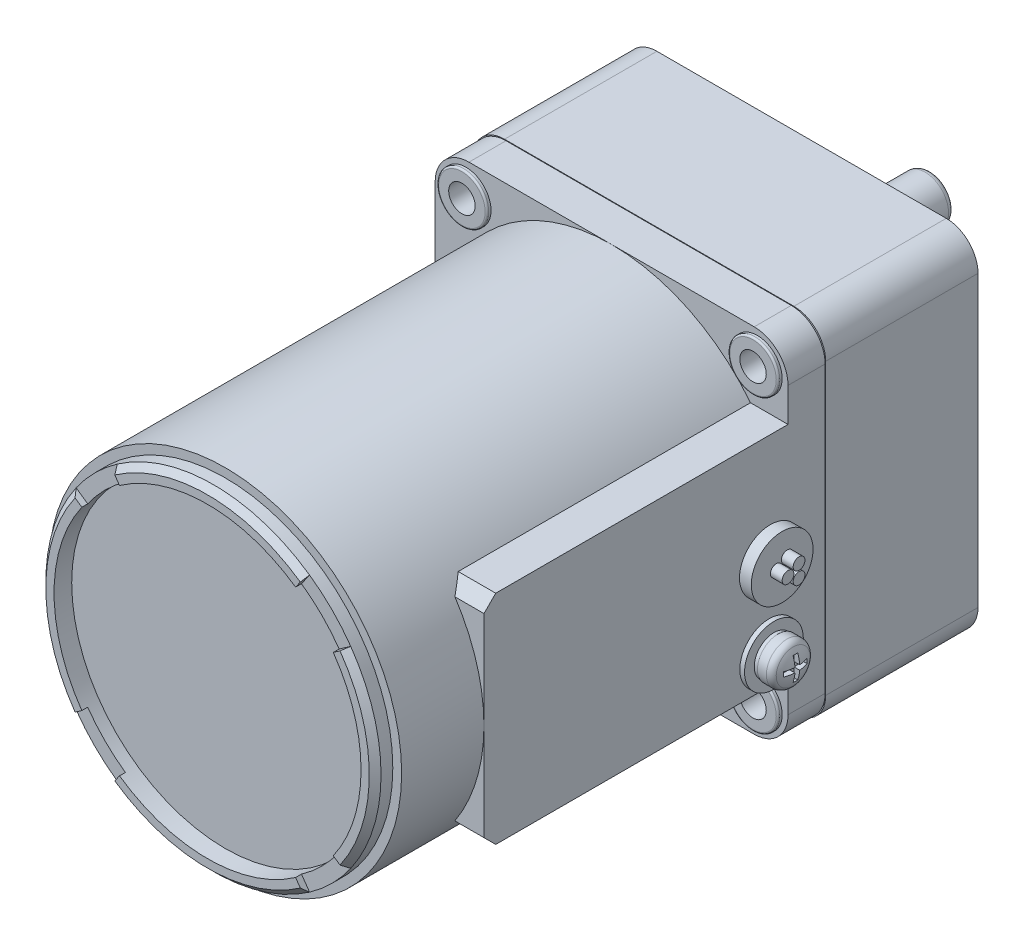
ISO-10303-21;
HEADER;
FILE_DESCRIPTION(('STEP AP214'),'2;1');
FILE_NAME('part.step','',(''),(''),'','','');
FILE_SCHEMA(('AUTOMOTIVE_DESIGN { 1 0 10303 214 1 1 1 1 }'));
ENDSEC;
DATA;
#1=APPLICATION_CONTEXT('core data for automotive mechanical design processes');
#2=APPLICATION_PROTOCOL_DEFINITION('international standard','automotive_design',2000,#1);
#3=PRODUCT_CONTEXT('',#1,'mechanical');
#4=PRODUCT('Part','Part','',(#3));
#5=PRODUCT_RELATED_PRODUCT_CATEGORY('part','',(#4));
#6=PRODUCT_DEFINITION_FORMATION('','',#4);
#7=PRODUCT_DEFINITION_CONTEXT('part definition',#1,'design');
#8=PRODUCT_DEFINITION('design','',#6,#7);
#9=PRODUCT_DEFINITION_SHAPE('','',#8);
#10=(LENGTH_UNIT() NAMED_UNIT(*) SI_UNIT(.MILLI.,.METRE.));
#11=(NAMED_UNIT(*) PLANE_ANGLE_UNIT() SI_UNIT($,.RADIAN.));
#12=(NAMED_UNIT(*) SI_UNIT($,.STERADIAN.) SOLID_ANGLE_UNIT());
#13=UNCERTAINTY_MEASURE_WITH_UNIT(LENGTH_MEASURE(1.E-05),#10,'distance_accuracy_value','');
#14=(GEOMETRIC_REPRESENTATION_CONTEXT(3) GLOBAL_UNCERTAINTY_ASSIGNED_CONTEXT((#13)) GLOBAL_UNIT_ASSIGNED_CONTEXT((#10,
#11,#12)) REPRESENTATION_CONTEXT('',''));
#15=CARTESIAN_POINT('',(0.,0.,0.));
#16=DIRECTION('',(0.,0.,1.));
#17=DIRECTION('',(1.,0.,0.));
#18=AXIS2_PLACEMENT_3D('',#15,#16,#17);
#19=CARTESIAN_POINT('',(0.,26.1,101.));
#20=DIRECTION('',(0.,0.,-1.));
#21=DIRECTION('',(-1.,0.,0.));
#22=AXIS2_PLACEMENT_3D('',#19,#20,#21);
#23=PLANE('',#22);
#24=CARTESIAN_POINT('',(0.,0.,101.));
#25=DIRECTION('',(0.,0.,1.));
#26=DIRECTION('',(1.,0.,0.));
#27=AXIS2_PLACEMENT_3D('',#24,#25,#26);
#28=CIRCLE('',#27,26.1);
#29=CARTESIAN_POINT('',(-21.3798683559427,14.9703449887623,101.));
#30=VERTEX_POINT('',#29);
#31=CARTESIAN_POINT('',(-21.3798683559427,-14.9703449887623,101.));
#32=VERTEX_POINT('',#31);
#33=EDGE_CURVE('E1166',#30,#32,#28,.T.);
#34=ORIENTED_EDGE('',*,*,#33,.F.);
#35=DIRECTION('',(0.819152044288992,-0.573576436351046,0.));
#36=VECTOR('',#35,1.);
#37=CARTESIAN_POINT('',(-23.3458332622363,16.3469284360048,101.));
#38=LINE('',#37,#36);
#39=CARTESIAN_POINT('',(-22.5266812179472,15.7733519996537,101.));
#40=VERTEX_POINT('',#39);
#41=EDGE_CURVE('E579',#40,#30,#38,.T.);
#42=ORIENTED_EDGE('',*,*,#41,.F.);
#43=CARTESIAN_POINT('',(0.,0.,101.));
#44=DIRECTION('',(0.,0.,1.));
#45=DIRECTION('',(1.,0.,0.));
#46=AXIS2_PLACEMENT_3D('',#43,#44,#45);
#47=CIRCLE('',#46,27.5);
#48=CARTESIAN_POINT('',(-22.5266812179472,-15.7733519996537,101.));
#49=VERTEX_POINT('',#48);
#50=EDGE_CURVE('E1144',#40,#49,#47,.T.);
#51=ORIENTED_EDGE('',*,*,#50,.T.);
#52=DIRECTION('',(-0.819152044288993,-0.573576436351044,0.));
#53=VECTOR('',#52,1.);
#54=CARTESIAN_POINT('',(-21.3798683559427,-14.9703449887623,101.));
#55=LINE('',#54,#53);
#56=EDGE_CURVE('E575',#32,#49,#55,.T.);
#57=ORIENTED_EDGE('',*,*,#56,.F.);
#58=EDGE_LOOP('',(#34,#42,#51,#57));
#59=FACE_BOUND('',#58,.T.);
#60=ADVANCED_FACE('F16',(#59),#23,.F.);
#61=CARTESIAN_POINT('',(15.7733519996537,22.5266812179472,101.));
#62=VERTEX_POINT('',#61);
#63=CARTESIAN_POINT('',(-15.7733519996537,22.5266812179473,101.));
#64=VERTEX_POINT('',#63);
#65=EDGE_CURVE('E662',#62,#64,#47,.T.);
#66=ORIENTED_EDGE('',*,*,#65,.T.);
#67=DIRECTION('',(-0.573576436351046,0.819152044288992,0.));
#68=VECTOR('',#67,1.);
#69=CARTESIAN_POINT('',(-14.9703449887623,21.3798683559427,101.));
#70=LINE('',#69,#68);
#71=CARTESIAN_POINT('',(-14.9703449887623,21.3798683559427,101.));
#72=VERTEX_POINT('',#71);
#73=EDGE_CURVE('E617',#72,#64,#70,.T.);
#74=ORIENTED_EDGE('',*,*,#73,.F.);
#75=CARTESIAN_POINT('',(14.9703449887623,21.3798683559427,101.));
#76=VERTEX_POINT('',#75);
#77=EDGE_CURVE('E667',#76,#72,#28,.T.);
#78=ORIENTED_EDGE('',*,*,#77,.F.);
#79=DIRECTION('',(-0.573576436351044,-0.819152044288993,0.));
#80=VECTOR('',#79,1.);
#81=CARTESIAN_POINT('',(16.3469284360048,23.3458332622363,101.));
#82=LINE('',#81,#80);
#83=EDGE_CURVE('E615',#62,#76,#82,.T.);
#84=ORIENTED_EDGE('',*,*,#83,.F.);
#85=EDGE_LOOP('',(#66,#74,#78,#84));
#86=FACE_BOUND('',#85,.T.);
#87=ADVANCED_FACE('F1056',(#86),#23,.F.);
#88=CARTESIAN_POINT('',(22.5266812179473,-15.7733519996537,101.));
#89=VERTEX_POINT('',#88);
#90=CARTESIAN_POINT('',(22.5266812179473,15.7733519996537,101.));
#91=VERTEX_POINT('',#90);
#92=EDGE_CURVE('E657',#89,#91,#47,.T.);
#93=ORIENTED_EDGE('',*,*,#92,.T.);
#94=DIRECTION('',(0.819152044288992,0.573576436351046,0.));
#95=VECTOR('',#94,1.);
#96=CARTESIAN_POINT('',(21.3798683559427,14.9703449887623,101.));
#97=LINE('',#96,#95);
#98=CARTESIAN_POINT('',(21.3798683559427,14.9703449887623,101.));
#99=VERTEX_POINT('',#98);
#100=EDGE_CURVE('E613',#99,#91,#97,.T.);
#101=ORIENTED_EDGE('',*,*,#100,.F.);
#102=CARTESIAN_POINT('',(21.3798683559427,-14.9703449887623,101.));
#103=VERTEX_POINT('',#102);
#104=EDGE_CURVE('E663',#103,#99,#28,.T.);
#105=ORIENTED_EDGE('',*,*,#104,.F.);
#106=DIRECTION('',(-0.819152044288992,0.573576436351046,0.));
#107=VECTOR('',#106,1.);
#108=CARTESIAN_POINT('',(23.3458332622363,-16.3469284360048,101.));
#109=LINE('',#108,#107);
#110=EDGE_CURVE('E611',#89,#103,#109,.T.);
#111=ORIENTED_EDGE('',*,*,#110,.F.);
#112=EDGE_LOOP('',(#93,#101,#105,#111));
#113=FACE_BOUND('',#112,.T.);
#114=ADVANCED_FACE('F1064',(#113),#23,.F.);
#115=CARTESIAN_POINT('',(0.,0.,100.));
#116=DIRECTION('',(0.,0.,-1.));
#117=DIRECTION('',(-1.,0.,0.));
#118=AXIS2_PLACEMENT_3D('',#115,#116,#117);
#119=CONICAL_SURFACE('',#118,28.5,0.785398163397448);
#120=ORIENTED_EDGE('',*,*,#50,.F.);
#121=DIRECTION('',(-0.579227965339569,0.405579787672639,-0.707106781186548));
#122=VECTOR('',#121,1.);
#123=CARTESIAN_POINT('',(0.,0.,128.5));
#124=LINE('',#123,#122);
#125=CARTESIAN_POINT('',(-23.3458332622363,16.3469284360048,100.));
#126=VERTEX_POINT('',#125);
#127=EDGE_CURVE('E954',#40,#126,#124,.T.);
#128=ORIENTED_EDGE('',*,*,#127,.T.);
#129=CARTESIAN_POINT('',(0.,0.,100.));
#130=DIRECTION('',(0.,0.,1.));
#131=DIRECTION('',(1.,0.,0.));
#132=AXIS2_PLACEMENT_3D('',#129,#130,#131);
#133=CIRCLE('',#132,28.5);
#134=CARTESIAN_POINT('',(-23.3458332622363,-16.3469284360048,100.));
#135=VERTEX_POINT('',#134);
#136=EDGE_CURVE('E1124',#126,#135,#133,.T.);
#137=ORIENTED_EDGE('',*,*,#136,.T.);
#138=DIRECTION('',(0.57922796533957,0.405579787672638,0.707106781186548));
#139=VECTOR('',#138,1.);
#140=CARTESIAN_POINT('',(0.,0.,128.5));
#141=LINE('',#140,#139);
#142=EDGE_CURVE('E933',#135,#49,#141,.T.);
#143=ORIENTED_EDGE('',*,*,#142,.T.);
#144=EDGE_LOOP('',(#120,#128,#137,#143));
#145=FACE_BOUND('',#144,.T.);
#146=ADVANCED_FACE('F1080',(#145),#119,.T.);
#147=CARTESIAN_POINT('',(16.3469284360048,23.3458332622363,100.));
#148=VERTEX_POINT('',#147);
#149=CARTESIAN_POINT('',(-16.3469284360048,23.3458332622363,100.));
#150=VERTEX_POINT('',#149);
#151=EDGE_CURVE('E658',#148,#150,#133,.T.);
#152=ORIENTED_EDGE('',*,*,#151,.T.);
#153=DIRECTION('',(0.405579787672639,-0.579227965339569,0.707106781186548));
#154=VECTOR('',#153,1.);
#155=CARTESIAN_POINT('',(0.,0.,128.5));
#156=LINE('',#155,#154);
#157=EDGE_CURVE('E951',#150,#64,#156,.T.);
#158=ORIENTED_EDGE('',*,*,#157,.T.);
#159=ORIENTED_EDGE('',*,*,#65,.F.);
#160=DIRECTION('',(0.405579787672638,0.57922796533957,-0.707106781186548));
#161=VECTOR('',#160,1.);
#162=CARTESIAN_POINT('',(0.,0.,128.5));
#163=LINE('',#162,#161);
#164=EDGE_CURVE('E948',#62,#148,#163,.T.);
#165=ORIENTED_EDGE('',*,*,#164,.T.);
#166=EDGE_LOOP('',(#152,#158,#159,#165));
#167=FACE_BOUND('',#166,.T.);
#168=ADVANCED_FACE('F1091',(#167),#119,.T.);
#169=CARTESIAN_POINT('',(23.3458332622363,-16.3469284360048,100.));
#170=VERTEX_POINT('',#169);
#171=CARTESIAN_POINT('',(23.3458332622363,16.3469284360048,100.));
#172=VERTEX_POINT('',#171);
#173=EDGE_CURVE('E653',#170,#172,#133,.T.);
#174=ORIENTED_EDGE('',*,*,#173,.T.);
#175=DIRECTION('',(-0.579227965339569,-0.405579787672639,0.707106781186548));
#176=VECTOR('',#175,1.);
#177=CARTESIAN_POINT('',(0.,0.,128.5));
#178=LINE('',#177,#176);
#179=EDGE_CURVE('E945',#172,#91,#178,.T.);
#180=ORIENTED_EDGE('',*,*,#179,.T.);
#181=ORIENTED_EDGE('',*,*,#92,.F.);
#182=DIRECTION('',(0.579227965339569,-0.405579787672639,-0.707106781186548));
#183=VECTOR('',#182,1.);
#184=CARTESIAN_POINT('',(0.,0.,128.5));
#185=LINE('',#184,#183);
#186=EDGE_CURVE('E942',#89,#170,#185,.T.);
#187=ORIENTED_EDGE('',*,*,#186,.T.);
#188=EDGE_LOOP('',(#174,#180,#181,#187));
#189=FACE_BOUND('',#188,.T.);
#190=ADVANCED_FACE('F1081',(#189),#119,.T.);
#191=CARTESIAN_POINT('',(-24.25,24.25,32.3));
#192=DIRECTION('',(0.,0.,1.));
#193=DIRECTION('',(1.,0.,0.));
#194=AXIS2_PLACEMENT_3D('',#191,#192,#193);
#195=PLANE('',#194);
#196=CARTESIAN_POINT('',(24.7487373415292,24.7487373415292,32.3));
#197=DIRECTION('',(0.,0.,1.));
#198=DIRECTION('',(1.,0.,0.));
#199=AXIS2_PLACEMENT_3D('',#196,#197,#198);
#200=CIRCLE('',#199,4.25);
#201=CARTESIAN_POINT('',(28.9987373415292,24.7487373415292,32.3));
#202=VERTEX_POINT('',#201);
#203=EDGE_CURVE('E520',#202,#202,#200,.T.);
#204=ORIENTED_EDGE('',*,*,#203,.F.);
#205=EDGE_LOOP('',(#204));
#206=FACE_BOUND('',#205,.T.);
#207=DIRECTION('',(-1.,0.,0.));
#208=VECTOR('',#207,1.);
#209=CARTESIAN_POINT('',(-24.25,18.5,32.3));
#210=LINE('',#209,#208);
#211=CARTESIAN_POINT('',(30.,18.5,32.3));
#212=VERTEX_POINT('',#211);
#213=CARTESIAN_POINT('',(23.6167313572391,18.5,32.3));
#214=VERTEX_POINT('',#213);
#215=EDGE_CURVE('E573',#212,#214,#210,.T.);
#216=ORIENTED_EDGE('',*,*,#215,.F.);
#217=DIRECTION('',(0.,1.,0.));
#218=VECTOR('',#217,1.);
#219=CARTESIAN_POINT('',(30.,-24.25,32.3));
#220=LINE('',#219,#218);
#221=CARTESIAN_POINT('',(30.,24.25,32.3));
#222=VERTEX_POINT('',#221);
#223=EDGE_CURVE('E787',#212,#222,#220,.T.);
#224=ORIENTED_EDGE('',*,*,#223,.T.);
#225=CARTESIAN_POINT('',(24.25,24.25,32.3));
#226=DIRECTION('',(0.,0.,1.));
#227=DIRECTION('',(1.,0.,0.));
#228=AXIS2_PLACEMENT_3D('',#225,#226,#227);
#229=CIRCLE('',#228,5.75);
#230=CARTESIAN_POINT('',(24.25,30.,32.3));
#231=VERTEX_POINT('',#230);
#232=EDGE_CURVE('E791',#222,#231,#229,.T.);
#233=ORIENTED_EDGE('',*,*,#232,.T.);
#234=DIRECTION('',(-1.,0.,0.));
#235=VECTOR('',#234,1.);
#236=CARTESIAN_POINT('',(24.25,30.,32.3));
#237=LINE('',#236,#235);
#238=CARTESIAN_POINT('',(0.,30.,32.3));
#239=VERTEX_POINT('',#238);
#240=EDGE_CURVE('E794',#231,#239,#237,.T.);
#241=ORIENTED_EDGE('',*,*,#240,.T.);
#242=CARTESIAN_POINT('',(0.,0.,32.3));
#243=DIRECTION('',(0.,0.,1.));
#244=DIRECTION('',(1.,0.,0.));
#245=AXIS2_PLACEMENT_3D('',#242,#243,#244);
#246=CIRCLE('',#245,30.);
#247=EDGE_CURVE('E643',#214,#239,#246,.T.);
#248=ORIENTED_EDGE('',*,*,#247,.F.);
#249=EDGE_LOOP('',(#216,#224,#233,#241,#248));
#250=FACE_BOUND('',#249,.T.);
#251=ADVANCED_FACE('F1973',(#206,#250),#195,.T.);
#252=CARTESIAN_POINT('',(-24.7487373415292,24.7487373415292,32.3));
#253=DIRECTION('',(0.,0.,1.));
#254=DIRECTION('',(1.,0.,0.));
#255=AXIS2_PLACEMENT_3D('',#252,#253,#254);
#256=CIRCLE('',#255,4.25);
#257=CARTESIAN_POINT('',(-20.4987373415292,24.7487373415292,32.3));
#258=VERTEX_POINT('',#257);
#259=EDGE_CURVE('E511',#258,#258,#256,.T.);
#260=ORIENTED_EDGE('',*,*,#259,.F.);
#261=EDGE_LOOP('',(#260));
#262=FACE_BOUND('',#261,.T.);
#263=CARTESIAN_POINT('',(-30.,0.,32.3));
#264=VERTEX_POINT('',#263);
#265=EDGE_CURVE('E646',#239,#264,#246,.T.);
#266=ORIENTED_EDGE('',*,*,#265,.F.);
#267=CARTESIAN_POINT('',(-24.25,30.,32.3));
#268=VERTEX_POINT('',#267);
#269=EDGE_CURVE('E793',#239,#268,#237,.T.);
#270=ORIENTED_EDGE('',*,*,#269,.T.);
#271=CARTESIAN_POINT('',(-24.25,24.25,32.3));
#272=DIRECTION('',(0.,0.,1.));
#273=DIRECTION('',(1.,0.,0.));
#274=AXIS2_PLACEMENT_3D('',#271,#272,#273);
#275=CIRCLE('',#274,5.75);
#276=CARTESIAN_POINT('',(-30.,24.25,32.3));
#277=VERTEX_POINT('',#276);
#278=EDGE_CURVE('E771',#268,#277,#275,.T.);
#279=ORIENTED_EDGE('',*,*,#278,.T.);
#280=DIRECTION('',(0.,-1.,0.));
#281=VECTOR('',#280,1.);
#282=CARTESIAN_POINT('',(-30.,24.25,32.3));
#283=LINE('',#282,#281);
#284=EDGE_CURVE('E776',#277,#264,#283,.T.);
#285=ORIENTED_EDGE('',*,*,#284,.T.);
#286=EDGE_LOOP('',(#266,#270,#279,#285));
#287=FACE_BOUND('',#286,.T.);
#288=ADVANCED_FACE('F2185',(#262,#287),#195,.T.);
#289=CARTESIAN_POINT('',(-24.7487373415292,-24.7487373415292,32.3));
#290=DIRECTION('',(0.,0.,1.));
#291=DIRECTION('',(1.,0.,0.));
#292=AXIS2_PLACEMENT_3D('',#289,#290,#291);
#293=CIRCLE('',#292,4.25);
#294=CARTESIAN_POINT('',(-20.4987373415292,-24.7487373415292,32.3));
#295=VERTEX_POINT('',#294);
#296=EDGE_CURVE('E529',#295,#295,#293,.T.);
#297=ORIENTED_EDGE('',*,*,#296,.F.);
#298=EDGE_LOOP('',(#297));
#299=FACE_BOUND('',#298,.T.);
#300=CARTESIAN_POINT('',(0.,-30.,32.3));
#301=VERTEX_POINT('',#300);
#302=EDGE_CURVE('E2456',#264,#301,#246,.T.);
#303=ORIENTED_EDGE('',*,*,#302,.F.);
#304=CARTESIAN_POINT('',(-30.,-24.25,32.3));
#305=VERTEX_POINT('',#304);
#306=EDGE_CURVE('E774',#264,#305,#283,.T.);
#307=ORIENTED_EDGE('',*,*,#306,.T.);
#308=CARTESIAN_POINT('',(-24.25,-24.25,32.3));
#309=DIRECTION('',(0.,0.,1.));
#310=DIRECTION('',(1.,0.,0.));
#311=AXIS2_PLACEMENT_3D('',#308,#309,#310);
#312=CIRCLE('',#311,5.75);
#313=CARTESIAN_POINT('',(-24.25,-30.,32.3));
#314=VERTEX_POINT('',#313);
#315=EDGE_CURVE('E779',#305,#314,#312,.T.);
#316=ORIENTED_EDGE('',*,*,#315,.T.);
#317=DIRECTION('',(1.,0.,0.));
#318=VECTOR('',#317,1.);
#319=CARTESIAN_POINT('',(-24.25,-30.,32.3));
#320=LINE('',#319,#318);
#321=EDGE_CURVE('E782',#314,#301,#320,.T.);
#322=ORIENTED_EDGE('',*,*,#321,.T.);
#323=EDGE_LOOP('',(#303,#307,#316,#322));
#324=FACE_BOUND('',#323,.T.);
#325=ADVANCED_FACE('F1878',(#299,#324),#195,.T.);
#326=CARTESIAN_POINT('',(-24.6,24.6,26.));
#327=DIRECTION('',(0.,0.,-1.));
#328=DIRECTION('',(-1.,0.,0.));
#329=AXIS2_PLACEMENT_3D('',#326,#327,#328);
#330=CYLINDRICAL_SURFACE('',#329,5.4);
#331=CARTESIAN_POINT('',(-24.6,24.6,25.9));
#332=DIRECTION('',(0.,0.,1.));
#333=DIRECTION('',(1.,0.,0.));
#334=AXIS2_PLACEMENT_3D('',#331,#332,#333);
#335=CIRCLE('',#334,5.4);
#336=CARTESIAN_POINT('',(-24.6,30.,25.9));
#337=VERTEX_POINT('',#336);
#338=CARTESIAN_POINT('',(-30.,24.6,25.9));
#339=VERTEX_POINT('',#338);
#340=EDGE_CURVE('E768',#337,#339,#335,.T.);
#341=ORIENTED_EDGE('',*,*,#340,.F.);
#342=DIRECTION('',(0.,0.,-1.));
#343=VECTOR('',#342,1.);
#344=CARTESIAN_POINT('',(-24.6,30.,26.));
#345=LINE('',#344,#343);
#346=CARTESIAN_POINT('',(-24.6,30.,0.));
#347=VERTEX_POINT('',#346);
#348=EDGE_CURVE('E862',#337,#347,#345,.T.);
#349=ORIENTED_EDGE('',*,*,#348,.T.);
#350=CARTESIAN_POINT('',(-24.6,24.6,0.));
#351=DIRECTION('',(0.,0.,1.));
#352=DIRECTION('',(1.,0.,0.));
#353=AXIS2_PLACEMENT_3D('',#350,#351,#352);
#354=CIRCLE('',#353,5.4);
#355=CARTESIAN_POINT('',(-30.,24.6,0.));
#356=VERTEX_POINT('',#355);
#357=EDGE_CURVE('E838',#347,#356,#354,.T.);
#358=ORIENTED_EDGE('',*,*,#357,.T.);
#359=DIRECTION('',(0.,0.,-1.));
#360=VECTOR('',#359,1.);
#361=CARTESIAN_POINT('',(-30.,24.6,26.));
#362=LINE('',#361,#360);
#363=EDGE_CURVE('E876',#339,#356,#362,.T.);
#364=ORIENTED_EDGE('',*,*,#363,.F.);
#365=EDGE_LOOP('',(#341,#349,#358,#364));
#366=FACE_BOUND('',#365,.T.);
#367=ADVANCED_FACE('F18',(#366),#330,.T.);
#368=CARTESIAN_POINT('',(-30.,24.6,26.));
#369=DIRECTION('',(1.,0.,0.));
#370=DIRECTION('',(0.,0.,-1.));
#371=AXIS2_PLACEMENT_3D('',#368,#369,#370);
#372=PLANE('',#371);
#373=DIRECTION('',(0.,-1.,0.));
#374=VECTOR('',#373,1.);
#375=CARTESIAN_POINT('',(-30.,30.,25.9));
#376=LINE('',#375,#374);
#377=CARTESIAN_POINT('',(-30.,-24.6,25.9));
#378=VERTEX_POINT('',#377);
#379=EDGE_CURVE('E738',#339,#378,#376,.T.);
#380=ORIENTED_EDGE('',*,*,#379,.F.);
#381=ORIENTED_EDGE('',*,*,#363,.T.);
#382=DIRECTION('',(0.,-1.,0.));
#383=VECTOR('',#382,1.);
#384=CARTESIAN_POINT('',(-30.,24.6,0.));
#385=LINE('',#384,#383);
#386=CARTESIAN_POINT('',(-30.,-24.6,0.));
#387=VERTEX_POINT('',#386);
#388=EDGE_CURVE('E841',#356,#387,#385,.T.);
#389=ORIENTED_EDGE('',*,*,#388,.T.);
#390=DIRECTION('',(0.,0.,-1.));
#391=VECTOR('',#390,1.);
#392=CARTESIAN_POINT('',(-30.,-24.6,26.));
#393=LINE('',#392,#391);
#394=EDGE_CURVE('E874',#378,#387,#393,.T.);
#395=ORIENTED_EDGE('',*,*,#394,.F.);
#396=EDGE_LOOP('',(#380,#381,#389,#395));
#397=FACE_BOUND('',#396,.T.);
#398=ADVANCED_FACE('F1877',(#397),#372,.F.);
#399=CARTESIAN_POINT('',(-24.6,-24.6,26.));
#400=DIRECTION('',(0.,0.,-1.));
#401=DIRECTION('',(-1.,0.,0.));
#402=AXIS2_PLACEMENT_3D('',#399,#400,#401);
#403=CYLINDRICAL_SURFACE('',#402,5.4);
#404=CARTESIAN_POINT('',(-24.6,-24.6,25.9));
#405=DIRECTION('',(0.,0.,1.));
#406=DIRECTION('',(1.,0.,0.));
#407=AXIS2_PLACEMENT_3D('',#404,#405,#406);
#408=CIRCLE('',#407,5.4);
#409=CARTESIAN_POINT('',(-24.6,-30.,25.9));
#410=VERTEX_POINT('',#409);
#411=EDGE_CURVE('E766',#378,#410,#408,.T.);
#412=ORIENTED_EDGE('',*,*,#411,.F.);
#413=ORIENTED_EDGE('',*,*,#394,.T.);
#414=CARTESIAN_POINT('',(-24.6,-24.6,0.));
#415=DIRECTION('',(0.,0.,1.));
#416=DIRECTION('',(1.,0.,0.));
#417=AXIS2_PLACEMENT_3D('',#414,#415,#416);
#418=CIRCLE('',#417,5.4);
#419=CARTESIAN_POINT('',(-24.6,-30.,0.));
#420=VERTEX_POINT('',#419);
#421=EDGE_CURVE('E844',#387,#420,#418,.T.);
#422=ORIENTED_EDGE('',*,*,#421,.T.);
#423=DIRECTION('',(0.,0.,-1.));
#424=VECTOR('',#423,1.);
#425=CARTESIAN_POINT('',(-24.6,-30.,26.));
#426=LINE('',#425,#424);
#427=EDGE_CURVE('E872',#410,#420,#426,.T.);
#428=ORIENTED_EDGE('',*,*,#427,.F.);
#429=EDGE_LOOP('',(#412,#413,#422,#428));
#430=FACE_BOUND('',#429,.T.);
#431=ADVANCED_FACE('F1909',(#430),#403,.T.);
#432=CARTESIAN_POINT('',(-24.6,-30.,26.));
#433=DIRECTION('',(0.,1.,0.));
#434=DIRECTION('',(0.,0.,1.));
#435=AXIS2_PLACEMENT_3D('',#432,#433,#434);
#436=PLANE('',#435);
#437=DIRECTION('',(1.,0.,0.));
#438=VECTOR('',#437,1.);
#439=CARTESIAN_POINT('',(-30.,-30.,25.9));
#440=LINE('',#439,#438);
#441=CARTESIAN_POINT('',(24.6,-30.,25.9));
#442=VERTEX_POINT('',#441);
#443=EDGE_CURVE('E741',#410,#442,#440,.T.);
#444=ORIENTED_EDGE('',*,*,#443,.F.);
#445=ORIENTED_EDGE('',*,*,#427,.T.);
#446=DIRECTION('',(1.,0.,0.));
#447=VECTOR('',#446,1.);
#448=CARTESIAN_POINT('',(-24.6,-30.,0.));
#449=LINE('',#448,#447);
#450=CARTESIAN_POINT('',(24.6,-30.,0.));
#451=VERTEX_POINT('',#450);
#452=EDGE_CURVE('E847',#420,#451,#449,.T.);
#453=ORIENTED_EDGE('',*,*,#452,.T.);
#454=DIRECTION('',(0.,0.,-1.));
#455=VECTOR('',#454,1.);
#456=CARTESIAN_POINT('',(24.6,-30.,26.));
#457=LINE('',#456,#455);
#458=EDGE_CURVE('E870',#442,#451,#457,.T.);
#459=ORIENTED_EDGE('',*,*,#458,.F.);
#460=EDGE_LOOP('',(#444,#445,#453,#459));
#461=FACE_BOUND('',#460,.T.);
#462=ADVANCED_FACE('F1914',(#461),#436,.F.);
#463=CARTESIAN_POINT('',(24.6,-24.6,26.));
#464=DIRECTION('',(0.,0.,-1.));
#465=DIRECTION('',(-1.,0.,0.));
#466=AXIS2_PLACEMENT_3D('',#463,#464,#465);
#467=CYLINDRICAL_SURFACE('',#466,5.4);
#468=CARTESIAN_POINT('',(24.6,-24.6,25.9));
#469=DIRECTION('',(0.,0.,1.));
#470=DIRECTION('',(1.,0.,0.));
#471=AXIS2_PLACEMENT_3D('',#468,#469,#470);
#472=CIRCLE('',#471,5.4);
#473=CARTESIAN_POINT('',(30.,-24.6,25.9));
#474=VERTEX_POINT('',#473);
#475=EDGE_CURVE('E764',#442,#474,#472,.T.);
#476=ORIENTED_EDGE('',*,*,#475,.F.);
#477=ORIENTED_EDGE('',*,*,#458,.T.);
#478=CARTESIAN_POINT('',(24.6,-24.6,0.));
#479=DIRECTION('',(0.,0.,1.));
#480=DIRECTION('',(1.,0.,0.));
#481=AXIS2_PLACEMENT_3D('',#478,#479,#480);
#482=CIRCLE('',#481,5.4);
#483=CARTESIAN_POINT('',(30.,-24.6,0.));
#484=VERTEX_POINT('',#483);
#485=EDGE_CURVE('E850',#451,#484,#482,.T.);
#486=ORIENTED_EDGE('',*,*,#485,.T.);
#487=DIRECTION('',(0.,0.,-1.));
#488=VECTOR('',#487,1.);
#489=CARTESIAN_POINT('',(30.,-24.6,26.));
#490=LINE('',#489,#488);
#491=EDGE_CURVE('E868',#474,#484,#490,.T.);
#492=ORIENTED_EDGE('',*,*,#491,.F.);
#493=EDGE_LOOP('',(#476,#477,#486,#492));
#494=FACE_BOUND('',#493,.T.);
#495=ADVANCED_FACE('F1963',(#494),#467,.T.);
#496=CARTESIAN_POINT('',(30.,-24.6,26.));
#497=DIRECTION('',(-1.,0.,0.));
#498=DIRECTION('',(0.,0.,1.));
#499=AXIS2_PLACEMENT_3D('',#496,#497,#498);
#500=PLANE('',#499);
#501=DIRECTION('',(0.,1.,0.));
#502=VECTOR('',#501,1.);
#503=CARTESIAN_POINT('',(30.,-30.,25.9));
#504=LINE('',#503,#502);
#505=CARTESIAN_POINT('',(30.,24.6,25.9));
#506=VERTEX_POINT('',#505);
#507=EDGE_CURVE('E743',#474,#506,#504,.T.);
#508=ORIENTED_EDGE('',*,*,#507,.F.);
#509=ORIENTED_EDGE('',*,*,#491,.T.);
#510=DIRECTION('',(0.,1.,0.));
#511=VECTOR('',#510,1.);
#512=CARTESIAN_POINT('',(30.,-24.6,0.));
#513=LINE('',#512,#511);
#514=CARTESIAN_POINT('',(30.,24.6,0.));
#515=VERTEX_POINT('',#514);
#516=EDGE_CURVE('E853',#484,#515,#513,.T.);
#517=ORIENTED_EDGE('',*,*,#516,.T.);
#518=DIRECTION('',(0.,0.,-1.));
#519=VECTOR('',#518,1.);
#520=CARTESIAN_POINT('',(30.,24.6,26.));
#521=LINE('',#520,#519);
#522=EDGE_CURVE('E866',#506,#515,#521,.T.);
#523=ORIENTED_EDGE('',*,*,#522,.F.);
#524=EDGE_LOOP('',(#508,#509,#517,#523));
#525=FACE_BOUND('',#524,.T.);
#526=ADVANCED_FACE('F1947',(#525),#500,.F.);
#527=CARTESIAN_POINT('',(24.6,24.6,26.));
#528=DIRECTION('',(0.,0.,-1.));
#529=DIRECTION('',(-1.,0.,0.));
#530=AXIS2_PLACEMENT_3D('',#527,#528,#529);
#531=CYLINDRICAL_SURFACE('',#530,5.4);
#532=CARTESIAN_POINT('',(24.6,24.6,25.9));
#533=DIRECTION('',(0.,0.,1.));
#534=DIRECTION('',(1.,0.,0.));
#535=AXIS2_PLACEMENT_3D('',#532,#533,#534);
#536=CIRCLE('',#535,5.4);
#537=CARTESIAN_POINT('',(24.6,30.,25.9));
#538=VERTEX_POINT('',#537);
#539=EDGE_CURVE('E745',#506,#538,#536,.T.);
#540=ORIENTED_EDGE('',*,*,#539,.F.);
#541=ORIENTED_EDGE('',*,*,#522,.T.);
#542=CARTESIAN_POINT('',(24.6,24.6,0.));
#543=DIRECTION('',(0.,0.,1.));
#544=DIRECTION('',(1.,0.,0.));
#545=AXIS2_PLACEMENT_3D('',#542,#543,#544);
#546=CIRCLE('',#545,5.4);
#547=CARTESIAN_POINT('',(24.6,30.,0.));
#548=VERTEX_POINT('',#547);
#549=EDGE_CURVE('E856',#515,#548,#546,.T.);
#550=ORIENTED_EDGE('',*,*,#549,.T.);
#551=DIRECTION('',(0.,0.,-1.));
#552=VECTOR('',#551,1.);
#553=CARTESIAN_POINT('',(24.6,30.,26.));
#554=LINE('',#553,#552);
#555=EDGE_CURVE('E864',#538,#548,#554,.T.);
#556=ORIENTED_EDGE('',*,*,#555,.F.);
#557=EDGE_LOOP('',(#540,#541,#550,#556));
#558=FACE_BOUND('',#557,.T.);
#559=ADVANCED_FACE('F2013',(#558),#531,.T.);
#560=CARTESIAN_POINT('',(24.6,30.,26.));
#561=DIRECTION('',(0.,-1.,0.));
#562=DIRECTION('',(0.,0.,-1.));
#563=AXIS2_PLACEMENT_3D('',#560,#561,#562);
#564=PLANE('',#563);
#565=DIRECTION('',(-1.,0.,0.));
#566=VECTOR('',#565,1.);
#567=CARTESIAN_POINT('',(30.,30.,25.9));
#568=LINE('',#567,#566);
#569=EDGE_CURVE('E736',#538,#337,#568,.T.);
#570=ORIENTED_EDGE('',*,*,#569,.F.);
#571=ORIENTED_EDGE('',*,*,#555,.T.);
#572=DIRECTION('',(-1.,0.,0.));
#573=VECTOR('',#572,1.);
#574=CARTESIAN_POINT('',(24.6,30.,0.));
#575=LINE('',#574,#573);
#576=EDGE_CURVE('E859',#548,#347,#575,.T.);
#577=ORIENTED_EDGE('',*,*,#576,.T.);
#578=ORIENTED_EDGE('',*,*,#348,.F.);
#579=EDGE_LOOP('',(#570,#571,#577,#578));
#580=FACE_BOUND('',#579,.T.);
#581=ADVANCED_FACE('F1838',(#580),#564,.F.);
#582=CARTESIAN_POINT('',(-24.6,24.6,0.));
#583=DIRECTION('',(0.,0.,1.));
#584=DIRECTION('',(1.,0.,0.));
#585=AXIS2_PLACEMENT_3D('',#582,#583,#584);
#586=PLANE('',#585);
#587=CARTESIAN_POINT('',(-24.7487373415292,24.7487373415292,0.));
#588=DIRECTION('',(0.,0.,1.));
#589=DIRECTION('',(1.,0.,0.));
#590=AXIS2_PLACEMENT_3D('',#587,#588,#589);
#591=CIRCLE('',#590,2.25);
#592=CARTESIAN_POINT('',(-22.4987373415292,24.7487373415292,0.));
#593=VERTEX_POINT('',#592);
#594=EDGE_CURVE('E2527',#593,#593,#591,.T.);
#595=ORIENTED_EDGE('',*,*,#594,.T.);
#596=EDGE_LOOP('',(#595));
#597=FACE_BOUND('',#596,.T.);
#598=CARTESIAN_POINT('',(24.7487373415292,24.7487373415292,0.));
#599=DIRECTION('',(0.,0.,1.));
#600=DIRECTION('',(1.,0.,0.));
#601=AXIS2_PLACEMENT_3D('',#598,#599,#600);
#602=CIRCLE('',#601,2.25);
#603=CARTESIAN_POINT('',(26.9987373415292,24.7487373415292,0.));
#604=VERTEX_POINT('',#603);
#605=EDGE_CURVE('E2531',#604,#604,#602,.T.);
#606=ORIENTED_EDGE('',*,*,#605,.T.);
#607=EDGE_LOOP('',(#606));
#608=FACE_BOUND('',#607,.T.);
#609=CARTESIAN_POINT('',(-24.7487373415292,-24.7487373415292,0.));
#610=DIRECTION('',(0.,0.,1.));
#611=DIRECTION('',(1.,0.,0.));
#612=AXIS2_PLACEMENT_3D('',#609,#610,#611);
#613=CIRCLE('',#612,2.25);
#614=CARTESIAN_POINT('',(-22.4987373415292,-24.7487373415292,0.));
#615=VERTEX_POINT('',#614);
#616=EDGE_CURVE('E2535',#615,#615,#613,.T.);
#617=ORIENTED_EDGE('',*,*,#616,.T.);
#618=EDGE_LOOP('',(#617));
#619=FACE_BOUND('',#618,.T.);
#620=CARTESIAN_POINT('',(24.7487373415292,-24.7487373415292,0.));
#621=DIRECTION('',(0.,0.,1.));
#622=DIRECTION('',(1.,0.,0.));
#623=AXIS2_PLACEMENT_3D('',#620,#621,#622);
#624=CIRCLE('',#623,2.25);
#625=CARTESIAN_POINT('',(26.9987373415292,-24.7487373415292,0.));
#626=VERTEX_POINT('',#625);
#627=EDGE_CURVE('E419',#626,#626,#624,.T.);
#628=ORIENTED_EDGE('',*,*,#627,.T.);
#629=EDGE_LOOP('',(#628));
#630=FACE_BOUND('',#629,.T.);
#631=CARTESIAN_POINT('',(-10.,0.,0.));
#632=DIRECTION('',(0.,0.,1.));
#633=DIRECTION('',(1.,0.,0.));
#634=AXIS2_PLACEMENT_3D('',#631,#632,#633);
#635=CIRCLE('',#634,12.5);
#636=CARTESIAN_POINT('',(2.5,0.,0.));
#637=VERTEX_POINT('',#636);
#638=EDGE_CURVE('E878',#637,#637,#635,.F.);
#639=ORIENTED_EDGE('',*,*,#638,.F.);
#640=EDGE_LOOP('',(#639));
#641=FACE_BOUND('',#640,.T.);
#642=ORIENTED_EDGE('',*,*,#357,.F.);
#643=ORIENTED_EDGE('',*,*,#576,.F.);
#644=ORIENTED_EDGE('',*,*,#549,.F.);
#645=ORIENTED_EDGE('',*,*,#516,.F.);
#646=ORIENTED_EDGE('',*,*,#485,.F.);
#647=ORIENTED_EDGE('',*,*,#452,.F.);
#648=ORIENTED_EDGE('',*,*,#421,.F.);
#649=ORIENTED_EDGE('',*,*,#388,.F.);
#650=EDGE_LOOP('',(#642,#643,#644,#645,#646,#647,#648,#649));
#651=FACE_BOUND('',#650,.T.);
#652=ADVANCED_FACE('F1952',(#597,#608,#619,#630,#641,#651),#586,.F.);
#653=CARTESIAN_POINT('',(-10.,0.,-32.));
#654=DIRECTION('',(0.,0.,1.));
#655=DIRECTION('',(1.,0.,0.));
#656=AXIS2_PLACEMENT_3D('',#653,#654,#655);
#657=CYLINDRICAL_SURFACE('',#656,12.5);
#658=ORIENTED_EDGE('',*,*,#638,.T.);
#659=EDGE_LOOP('',(#658));
#660=FACE_BOUND('',#659,.T.);
#661=CARTESIAN_POINT('',(-10.,0.,-5.));
#662=DIRECTION('',(0.,0.,1.));
#663=DIRECTION('',(1.,0.,0.));
#664=AXIS2_PLACEMENT_3D('',#661,#662,#663);
#665=CIRCLE('',#664,12.5);
#666=CARTESIAN_POINT('',(2.5,0.,-5.));
#667=VERTEX_POINT('',#666);
#668=EDGE_CURVE('E835',#667,#667,#665,.T.);
#669=ORIENTED_EDGE('',*,*,#668,.T.);
#670=EDGE_LOOP('',(#669));
#671=FACE_BOUND('',#670,.T.);
#672=ADVANCED_FACE('F1957',(#660,#671),#657,.T.);
#673=CARTESIAN_POINT('',(-10.,0.,-5.));
#674=DIRECTION('',(0.,0.,1.));
#675=DIRECTION('',(1.,0.,0.));
#676=AXIS2_PLACEMENT_3D('',#673,#674,#675);
#677=TOROIDAL_SURFACE('',#676,11.5,1.);
#678=ORIENTED_EDGE('',*,*,#668,.F.);
#679=EDGE_LOOP('',(#678));
#680=FACE_BOUND('',#679,.T.);
#681=CARTESIAN_POINT('',(-10.,0.,-6.));
#682=DIRECTION('',(0.,0.,1.));
#683=DIRECTION('',(1.,0.,0.));
#684=AXIS2_PLACEMENT_3D('',#681,#682,#683);
#685=CIRCLE('',#684,11.5);
#686=CARTESIAN_POINT('',(1.5,0.,-6.));
#687=VERTEX_POINT('',#686);
#688=EDGE_CURVE('E832',#687,#687,#685,.T.);
#689=ORIENTED_EDGE('',*,*,#688,.T.);
#690=EDGE_LOOP('',(#689));
#691=FACE_BOUND('',#690,.T.);
#692=ADVANCED_FACE('F2006',(#680,#691),#677,.T.);
#693=CARTESIAN_POINT('',(-21.5,0.,-6.));
#694=DIRECTION('',(0.,0.,1.));
#695=DIRECTION('',(1.,0.,0.));
#696=AXIS2_PLACEMENT_3D('',#693,#694,#695);
#697=PLANE('',#696);
#698=ORIENTED_EDGE('',*,*,#688,.F.);
#699=EDGE_LOOP('',(#698));
#700=FACE_BOUND('',#699,.T.);
#701=CARTESIAN_POINT('',(-10.,0.,-6.));
#702=DIRECTION('',(0.,0.,1.));
#703=DIRECTION('',(1.,0.,0.));
#704=AXIS2_PLACEMENT_3D('',#701,#702,#703);
#705=CIRCLE('',#704,4.);
#706=CARTESIAN_POINT('',(-6.,0.,-6.));
#707=VERTEX_POINT('',#706);
#708=EDGE_CURVE('E829',#707,#707,#705,.T.);
#709=ORIENTED_EDGE('',*,*,#708,.T.);
#710=EDGE_LOOP('',(#709));
#711=FACE_BOUND('',#710,.T.);
#712=ADVANCED_FACE('F2000',(#700,#711),#697,.F.);
#713=CARTESIAN_POINT('',(-10.,0.,-32.));
#714=DIRECTION('',(0.,0.,1.));
#715=DIRECTION('',(1.,0.,0.));
#716=AXIS2_PLACEMENT_3D('',#713,#714,#715);
#717=CYLINDRICAL_SURFACE('',#716,4.);
#718=ORIENTED_EDGE('',*,*,#708,.F.);
#719=EDGE_LOOP('',(#718));
#720=FACE_BOUND('',#719,.T.);
#721=CARTESIAN_POINT('',(-10.,0.,-31.));
#722=DIRECTION('',(0.,0.,1.));
#723=DIRECTION('',(1.,0.,0.));
#724=AXIS2_PLACEMENT_3D('',#721,#722,#723);
#725=CIRCLE('',#724,4.);
#726=CARTESIAN_POINT('',(-6.,0.,-31.));
#727=VERTEX_POINT('',#726);
#728=EDGE_CURVE('E825',#727,#727,#725,.T.);
#729=ORIENTED_EDGE('',*,*,#728,.T.);
#730=EDGE_LOOP('',(#729));
#731=FACE_BOUND('',#730,.T.);
#732=ADVANCED_FACE('F2005',(#720,#731),#717,.T.);
#733=CARTESIAN_POINT('',(-10.,0.,-31.));
#734=DIRECTION('',(0.,0.,1.));
#735=DIRECTION('',(1.,0.,0.));
#736=AXIS2_PLACEMENT_3D('',#733,#734,#735);
#737=TOROIDAL_SURFACE('',#736,3.,1.);
#738=ORIENTED_EDGE('',*,*,#728,.F.);
#739=EDGE_LOOP('',(#738));
#740=FACE_BOUND('',#739,.T.);
#741=CARTESIAN_POINT('',(-10.,0.,-32.));
#742=DIRECTION('',(0.,0.,1.));
#743=DIRECTION('',(1.,0.,0.));
#744=AXIS2_PLACEMENT_3D('',#741,#742,#743);
#745=CIRCLE('',#744,3.);
#746=CARTESIAN_POINT('',(-7.,0.,-32.));
#747=VERTEX_POINT('',#746);
#748=EDGE_CURVE('E822',#747,#747,#745,.T.);
#749=ORIENTED_EDGE('',*,*,#748,.T.);
#750=EDGE_LOOP('',(#749));
#751=FACE_BOUND('',#750,.T.);
#752=ADVANCED_FACE('F2040',(#740,#751),#737,.T.);
#753=CARTESIAN_POINT('',(-13.,0.,-32.));
#754=DIRECTION('',(0.,0.,1.));
#755=DIRECTION('',(1.,0.,0.));
#756=AXIS2_PLACEMENT_3D('',#753,#754,#755);
#757=PLANE('',#756);
#758=ORIENTED_EDGE('',*,*,#748,.F.);
#759=EDGE_LOOP('',(#758));
#760=FACE_BOUND('',#759,.T.);
#761=ADVANCED_FACE('F2035',(#760),#757,.F.);
#762=CARTESIAN_POINT('',(0.,0.,25.9));
#763=DIRECTION('',(0.,0.,1.));
#764=DIRECTION('',(1.,0.,0.));
#765=AXIS2_PLACEMENT_3D('',#762,#763,#764);
#766=PLANE('',#765);
#767=DIRECTION('',(-1.,0.,0.));
#768=VECTOR('',#767,1.);
#769=CARTESIAN_POINT('',(24.25,29.,25.9));
#770=LINE('',#769,#768);
#771=CARTESIAN_POINT('',(24.25,29.,25.9));
#772=VERTEX_POINT('',#771);
#773=CARTESIAN_POINT('',(-24.25,29.,25.9));
#774=VERTEX_POINT('',#773);
#775=EDGE_CURVE('E694',#772,#774,#770,.T.);
#776=ORIENTED_EDGE('',*,*,#775,.F.);
#777=CARTESIAN_POINT('',(24.25,24.25,25.9));
#778=DIRECTION('',(0.,0.,1.));
#779=DIRECTION('',(1.,0.,0.));
#780=AXIS2_PLACEMENT_3D('',#777,#778,#779);
#781=CIRCLE('',#780,4.75);
#782=CARTESIAN_POINT('',(29.,24.25,25.9));
#783=VERTEX_POINT('',#782);
#784=EDGE_CURVE('E691',#783,#772,#781,.T.);
#785=ORIENTED_EDGE('',*,*,#784,.F.);
#786=DIRECTION('',(0.,1.,0.));
#787=VECTOR('',#786,1.);
#788=CARTESIAN_POINT('',(29.,-24.25,25.9));
#789=LINE('',#788,#787);
#790=CARTESIAN_POINT('',(29.,-24.25,25.9));
#791=VERTEX_POINT('',#790);
#792=EDGE_CURVE('E688',#791,#783,#789,.T.);
#793=ORIENTED_EDGE('',*,*,#792,.F.);
#794=CARTESIAN_POINT('',(24.25,-24.25,25.9));
#795=DIRECTION('',(0.,0.,1.));
#796=DIRECTION('',(1.,0.,0.));
#797=AXIS2_PLACEMENT_3D('',#794,#795,#796);
#798=CIRCLE('',#797,4.75);
#799=CARTESIAN_POINT('',(24.25,-29.,25.9));
#800=VERTEX_POINT('',#799);
#801=EDGE_CURVE('E685',#800,#791,#798,.T.);
#802=ORIENTED_EDGE('',*,*,#801,.F.);
#803=DIRECTION('',(1.,0.,0.));
#804=VECTOR('',#803,1.);
#805=CARTESIAN_POINT('',(-24.25,-29.,25.9));
#806=LINE('',#805,#804);
#807=CARTESIAN_POINT('',(-24.25,-29.,25.9));
#808=VERTEX_POINT('',#807);
#809=EDGE_CURVE('E682',#808,#800,#806,.T.);
#810=ORIENTED_EDGE('',*,*,#809,.F.);
#811=CARTESIAN_POINT('',(-24.25,-24.25,25.9));
#812=DIRECTION('',(0.,0.,1.));
#813=DIRECTION('',(1.,0.,0.));
#814=AXIS2_PLACEMENT_3D('',#811,#812,#813);
#815=CIRCLE('',#814,4.75);
#816=CARTESIAN_POINT('',(-29.,-24.25,25.9));
#817=VERTEX_POINT('',#816);
#818=EDGE_CURVE('E679',#817,#808,#815,.T.);
#819=ORIENTED_EDGE('',*,*,#818,.F.);
#820=DIRECTION('',(0.,-1.,0.));
#821=VECTOR('',#820,1.);
#822=CARTESIAN_POINT('',(-29.,24.25,25.9));
#823=LINE('',#822,#821);
#824=CARTESIAN_POINT('',(-29.,24.25,25.9));
#825=VERTEX_POINT('',#824);
#826=EDGE_CURVE('E675',#825,#817,#823,.T.);
#827=ORIENTED_EDGE('',*,*,#826,.F.);
#828=CARTESIAN_POINT('',(-24.25,24.25,25.9));
#829=DIRECTION('',(0.,0.,1.));
#830=DIRECTION('',(1.,0.,0.));
#831=AXIS2_PLACEMENT_3D('',#828,#829,#830);
#832=CIRCLE('',#831,4.75);
#833=EDGE_CURVE('E672',#774,#825,#832,.T.);
#834=ORIENTED_EDGE('',*,*,#833,.F.);
#835=EDGE_LOOP('',(#776,#785,#793,#802,#810,#819,#827,#834));
#836=FACE_BOUND('',#835,.T.);
#837=ORIENTED_EDGE('',*,*,#340,.T.);
#838=ORIENTED_EDGE('',*,*,#379,.T.);
#839=ORIENTED_EDGE('',*,*,#411,.T.);
#840=ORIENTED_EDGE('',*,*,#443,.T.);
#841=ORIENTED_EDGE('',*,*,#475,.T.);
#842=ORIENTED_EDGE('',*,*,#507,.T.);
#843=ORIENTED_EDGE('',*,*,#539,.T.);
#844=ORIENTED_EDGE('',*,*,#569,.T.);
#845=EDGE_LOOP('',(#837,#838,#839,#840,#841,#842,#843,#844));
#846=FACE_BOUND('',#845,.T.);
#847=ADVANCED_FACE('F2039',(#836,#846),#766,.T.);
#848=CARTESIAN_POINT('',(0.,0.,26.));
#849=DIRECTION('',(0.,0.,1.));
#850=DIRECTION('',(1.,0.,0.));
#851=AXIS2_PLACEMENT_3D('',#848,#849,#850);
#852=PLANE('',#851);
#853=DIRECTION('',(0.,1.,0.));
#854=VECTOR('',#853,1.);
#855=CARTESIAN_POINT('',(29.,-24.25,26.));
#856=LINE('',#855,#854);
#857=CARTESIAN_POINT('',(29.,-24.25,26.));
#858=VERTEX_POINT('',#857);
#859=CARTESIAN_POINT('',(29.,24.25,26.));
#860=VERTEX_POINT('',#859);
#861=EDGE_CURVE('E711',#858,#860,#856,.T.);
#862=ORIENTED_EDGE('',*,*,#861,.T.);
#863=CARTESIAN_POINT('',(24.25,24.25,26.));
#864=DIRECTION('',(0.,0.,1.));
#865=DIRECTION('',(1.,0.,0.));
#866=AXIS2_PLACEMENT_3D('',#863,#864,#865);
#867=CIRCLE('',#866,4.75);
#868=CARTESIAN_POINT('',(24.25,29.,26.));
#869=VERTEX_POINT('',#868);
#870=EDGE_CURVE('E713',#860,#869,#867,.T.);
#871=ORIENTED_EDGE('',*,*,#870,.T.);
#872=DIRECTION('',(-1.,0.,0.));
#873=VECTOR('',#872,1.);
#874=CARTESIAN_POINT('',(24.25,29.,26.));
#875=LINE('',#874,#873);
#876=CARTESIAN_POINT('',(-24.25,29.,26.));
#877=VERTEX_POINT('',#876);
#878=EDGE_CURVE('E676',#869,#877,#875,.T.);
#879=ORIENTED_EDGE('',*,*,#878,.T.);
#880=CARTESIAN_POINT('',(-24.25,24.25,26.));
#881=DIRECTION('',(0.,0.,1.));
#882=DIRECTION('',(1.,0.,0.));
#883=AXIS2_PLACEMENT_3D('',#880,#881,#882);
#884=CIRCLE('',#883,4.75);
#885=CARTESIAN_POINT('',(-29.,24.25,26.));
#886=VERTEX_POINT('',#885);
#887=EDGE_CURVE('E671',#877,#886,#884,.T.);
#888=ORIENTED_EDGE('',*,*,#887,.T.);
#889=DIRECTION('',(0.,-1.,0.));
#890=VECTOR('',#889,1.);
#891=CARTESIAN_POINT('',(-29.,24.25,26.));
#892=LINE('',#891,#890);
#893=CARTESIAN_POINT('',(-29.,-24.25,26.));
#894=VERTEX_POINT('',#893);
#895=EDGE_CURVE('E699',#886,#894,#892,.T.);
#896=ORIENTED_EDGE('',*,*,#895,.T.);
#897=CARTESIAN_POINT('',(-24.25,-24.25,26.));
#898=DIRECTION('',(0.,0.,1.));
#899=DIRECTION('',(1.,0.,0.));
#900=AXIS2_PLACEMENT_3D('',#897,#898,#899);
#901=CIRCLE('',#900,4.75);
#902=CARTESIAN_POINT('',(-24.25,-29.,26.));
#903=VERTEX_POINT('',#902);
#904=EDGE_CURVE('E702',#894,#903,#901,.T.);
#905=ORIENTED_EDGE('',*,*,#904,.T.);
#906=DIRECTION('',(1.,0.,0.));
#907=VECTOR('',#906,1.);
#908=CARTESIAN_POINT('',(-24.25,-29.,26.));
#909=LINE('',#908,#907);
#910=CARTESIAN_POINT('',(24.25,-29.,26.));
#911=VERTEX_POINT('',#910);
#912=EDGE_CURVE('E705',#903,#911,#909,.T.);
#913=ORIENTED_EDGE('',*,*,#912,.T.);
#914=CARTESIAN_POINT('',(24.25,-24.25,26.));
#915=DIRECTION('',(0.,0.,1.));
#916=DIRECTION('',(1.,0.,0.));
#917=AXIS2_PLACEMENT_3D('',#914,#915,#916);
#918=CIRCLE('',#917,4.75);
#919=EDGE_CURVE('E708',#911,#858,#918,.T.);
#920=ORIENTED_EDGE('',*,*,#919,.T.);
#921=EDGE_LOOP('',(#862,#871,#879,#888,#896,#905,#913,#920));
#922=FACE_BOUND('',#921,.T.);
#923=CARTESIAN_POINT('',(24.25,24.25,26.));
#924=DIRECTION('',(0.,0.,1.));
#925=DIRECTION('',(1.,0.,0.));
#926=AXIS2_PLACEMENT_3D('',#923,#924,#925);
#927=CIRCLE('',#926,5.75);
#928=CARTESIAN_POINT('',(30.,24.25,26.));
#929=VERTEX_POINT('',#928);
#930=CARTESIAN_POINT('',(24.25,30.,26.));
#931=VERTEX_POINT('',#930);
#932=EDGE_CURVE('E775',#929,#931,#927,.T.);
#933=ORIENTED_EDGE('',*,*,#932,.F.);
#934=DIRECTION('',(0.,1.,0.));
#935=VECTOR('',#934,1.);
#936=CARTESIAN_POINT('',(30.,-30.,26.));
#937=LINE('',#936,#935);
#938=CARTESIAN_POINT('',(30.,-24.25,26.));
#939=VERTEX_POINT('',#938);
#940=EDGE_CURVE('E739',#939,#929,#937,.T.);
#941=ORIENTED_EDGE('',*,*,#940,.F.);
#942=CARTESIAN_POINT('',(24.25,-24.25,26.));
#943=DIRECTION('',(0.,0.,1.));
#944=DIRECTION('',(1.,0.,0.));
#945=AXIS2_PLACEMENT_3D('',#942,#943,#944);
#946=CIRCLE('',#945,5.75);
#947=CARTESIAN_POINT('',(24.25,-30.,26.));
#948=VERTEX_POINT('',#947);
#949=EDGE_CURVE('E817',#948,#939,#946,.T.);
#950=ORIENTED_EDGE('',*,*,#949,.F.);
#951=DIRECTION('',(1.,0.,0.));
#952=VECTOR('',#951,1.);
#953=CARTESIAN_POINT('',(-30.,-30.,26.));
#954=LINE('',#953,#952);
#955=CARTESIAN_POINT('',(-24.25,-30.,26.));
#956=VERTEX_POINT('',#955);
#957=EDGE_CURVE('E758',#956,#948,#954,.T.);
#958=ORIENTED_EDGE('',*,*,#957,.F.);
#959=CARTESIAN_POINT('',(-24.25,-24.25,26.));
#960=DIRECTION('',(0.,0.,1.));
#961=DIRECTION('',(1.,0.,0.));
#962=AXIS2_PLACEMENT_3D('',#959,#960,#961);
#963=CIRCLE('',#962,5.75);
#964=CARTESIAN_POINT('',(-30.,-24.25,26.));
#965=VERTEX_POINT('',#964);
#966=EDGE_CURVE('E806',#965,#956,#963,.T.);
#967=ORIENTED_EDGE('',*,*,#966,.F.);
#968=DIRECTION('',(0.,-1.,0.));
#969=VECTOR('',#968,1.);
#970=CARTESIAN_POINT('',(-30.,30.,26.));
#971=LINE('',#970,#969);
#972=CARTESIAN_POINT('',(-30.,24.25,26.));
#973=VERTEX_POINT('',#972);
#974=EDGE_CURVE('E754',#973,#965,#971,.T.);
#975=ORIENTED_EDGE('',*,*,#974,.F.);
#976=CARTESIAN_POINT('',(-24.25,24.25,26.));
#977=DIRECTION('',(0.,0.,1.));
#978=DIRECTION('',(1.,0.,0.));
#979=AXIS2_PLACEMENT_3D('',#976,#977,#978);
#980=CIRCLE('',#979,5.75);
#981=CARTESIAN_POINT('',(-24.25,30.,26.));
#982=VERTEX_POINT('',#981);
#983=EDGE_CURVE('E770',#982,#973,#980,.T.);
#984=ORIENTED_EDGE('',*,*,#983,.F.);
#985=DIRECTION('',(-1.,0.,0.));
#986=VECTOR('',#985,1.);
#987=CARTESIAN_POINT('',(30.,30.,26.));
#988=LINE('',#987,#986);
#989=EDGE_CURVE('E720',#931,#982,#988,.T.);
#990=ORIENTED_EDGE('',*,*,#989,.F.);
#991=EDGE_LOOP('',(#933,#941,#950,#958,#967,#975,#984,#990));
#992=FACE_BOUND('',#991,.T.);
#993=ADVANCED_FACE('F905',(#922,#992),#852,.F.);
#994=CARTESIAN_POINT('',(-24.25,24.25,25.9));
#995=DIRECTION('',(0.,0.,1.));
#996=DIRECTION('',(1.,0.,0.));
#997=AXIS2_PLACEMENT_3D('',#994,#995,#996);
#998=CYLINDRICAL_SURFACE('',#997,4.75);
#999=ORIENTED_EDGE('',*,*,#887,.F.);
#1000=DIRECTION('',(0.,0.,1.));
#1001=VECTOR('',#1000,1.);
#1002=CARTESIAN_POINT('',(-24.25,29.,25.9));
#1003=LINE('',#1002,#1001);
#1004=EDGE_CURVE('E718',#774,#877,#1003,.T.);
#1005=ORIENTED_EDGE('',*,*,#1004,.F.);
#1006=ORIENTED_EDGE('',*,*,#833,.T.);
#1007=DIRECTION('',(0.,0.,1.));
#1008=VECTOR('',#1007,1.);
#1009=CARTESIAN_POINT('',(-29.,24.25,25.9));
#1010=LINE('',#1009,#1008);
#1011=EDGE_CURVE('E697',#825,#886,#1010,.T.);
#1012=ORIENTED_EDGE('',*,*,#1011,.T.);
#1013=EDGE_LOOP('',(#999,#1005,#1006,#1012));
#1014=FACE_BOUND('',#1013,.T.);
#1015=ADVANCED_FACE('F2100',(#1014),#998,.T.);
#1016=CARTESIAN_POINT('',(24.25,29.,25.9));
#1017=DIRECTION('',(0.,1.,0.));
#1018=DIRECTION('',(0.,0.,1.));
#1019=AXIS2_PLACEMENT_3D('',#1016,#1017,#1018);
#1020=PLANE('',#1019);
#1021=ORIENTED_EDGE('',*,*,#878,.F.);
#1022=DIRECTION('',(0.,0.,1.));
#1023=VECTOR('',#1022,1.);
#1024=CARTESIAN_POINT('',(24.25,29.,25.9));
#1025=LINE('',#1024,#1023);
#1026=EDGE_CURVE('E721',#772,#869,#1025,.T.);
#1027=ORIENTED_EDGE('',*,*,#1026,.F.);
#1028=ORIENTED_EDGE('',*,*,#775,.T.);
#1029=ORIENTED_EDGE('',*,*,#1004,.T.);
#1030=EDGE_LOOP('',(#1021,#1027,#1028,#1029));
#1031=FACE_BOUND('',#1030,.T.);
#1032=ADVANCED_FACE('F2105',(#1031),#1020,.T.);
#1033=CARTESIAN_POINT('',(24.25,24.25,25.9));
#1034=DIRECTION('',(0.,0.,1.));
#1035=DIRECTION('',(1.,0.,0.));
#1036=AXIS2_PLACEMENT_3D('',#1033,#1034,#1035);
#1037=CYLINDRICAL_SURFACE('',#1036,4.75);
#1038=ORIENTED_EDGE('',*,*,#870,.F.);
#1039=DIRECTION('',(0.,0.,1.));
#1040=VECTOR('',#1039,1.);
#1041=CARTESIAN_POINT('',(29.,24.25,25.9));
#1042=LINE('',#1041,#1040);
#1043=EDGE_CURVE('E723',#783,#860,#1042,.T.);
#1044=ORIENTED_EDGE('',*,*,#1043,.F.);
#1045=ORIENTED_EDGE('',*,*,#784,.T.);
#1046=ORIENTED_EDGE('',*,*,#1026,.T.);
#1047=EDGE_LOOP('',(#1038,#1044,#1045,#1046));
#1048=FACE_BOUND('',#1047,.T.);
#1049=ADVANCED_FACE('F2138',(#1048),#1037,.T.);
#1050=CARTESIAN_POINT('',(29.,-24.25,25.9));
#1051=DIRECTION('',(1.,0.,0.));
#1052=DIRECTION('',(0.,0.,-1.));
#1053=AXIS2_PLACEMENT_3D('',#1050,#1051,#1052);
#1054=PLANE('',#1053);
#1055=ORIENTED_EDGE('',*,*,#861,.F.);
#1056=DIRECTION('',(0.,0.,1.));
#1057=VECTOR('',#1056,1.);
#1058=CARTESIAN_POINT('',(29.,-24.25,25.9));
#1059=LINE('',#1058,#1057);
#1060=EDGE_CURVE('E726',#791,#858,#1059,.T.);
#1061=ORIENTED_EDGE('',*,*,#1060,.F.);
#1062=ORIENTED_EDGE('',*,*,#792,.T.);
#1063=ORIENTED_EDGE('',*,*,#1043,.T.);
#1064=EDGE_LOOP('',(#1055,#1061,#1062,#1063));
#1065=FACE_BOUND('',#1064,.T.);
#1066=ADVANCED_FACE('F2143',(#1065),#1054,.T.);
#1067=CARTESIAN_POINT('',(24.25,-24.25,25.9));
#1068=DIRECTION('',(0.,0.,1.));
#1069=DIRECTION('',(1.,0.,0.));
#1070=AXIS2_PLACEMENT_3D('',#1067,#1068,#1069);
#1071=CYLINDRICAL_SURFACE('',#1070,4.75);
#1072=ORIENTED_EDGE('',*,*,#919,.F.);
#1073=DIRECTION('',(0.,0.,1.));
#1074=VECTOR('',#1073,1.);
#1075=CARTESIAN_POINT('',(24.25,-29.,25.9));
#1076=LINE('',#1075,#1074);
#1077=EDGE_CURVE('E728',#800,#911,#1076,.T.);
#1078=ORIENTED_EDGE('',*,*,#1077,.F.);
#1079=ORIENTED_EDGE('',*,*,#801,.T.);
#1080=ORIENTED_EDGE('',*,*,#1060,.T.);
#1081=EDGE_LOOP('',(#1072,#1078,#1079,#1080));
#1082=FACE_BOUND('',#1081,.T.);
#1083=ADVANCED_FACE('F2164',(#1082),#1071,.T.);
#1084=CARTESIAN_POINT('',(-24.25,-29.,25.9));
#1085=DIRECTION('',(0.,-1.,0.));
#1086=DIRECTION('',(0.,0.,-1.));
#1087=AXIS2_PLACEMENT_3D('',#1084,#1085,#1086);
#1088=PLANE('',#1087);
#1089=ORIENTED_EDGE('',*,*,#912,.F.);
#1090=DIRECTION('',(0.,0.,1.));
#1091=VECTOR('',#1090,1.);
#1092=CARTESIAN_POINT('',(-24.25,-29.,25.9));
#1093=LINE('',#1092,#1091);
#1094=EDGE_CURVE('E730',#808,#903,#1093,.T.);
#1095=ORIENTED_EDGE('',*,*,#1094,.F.);
#1096=ORIENTED_EDGE('',*,*,#809,.T.);
#1097=ORIENTED_EDGE('',*,*,#1077,.T.);
#1098=EDGE_LOOP('',(#1089,#1095,#1096,#1097));
#1099=FACE_BOUND('',#1098,.T.);
#1100=ADVANCED_FACE('F2169',(#1099),#1088,.T.);
#1101=CARTESIAN_POINT('',(-24.25,-24.25,25.9));
#1102=DIRECTION('',(0.,0.,1.));
#1103=DIRECTION('',(1.,0.,0.));
#1104=AXIS2_PLACEMENT_3D('',#1101,#1102,#1103);
#1105=CYLINDRICAL_SURFACE('',#1104,4.75);
#1106=ORIENTED_EDGE('',*,*,#904,.F.);
#1107=DIRECTION('',(0.,0.,1.));
#1108=VECTOR('',#1107,1.);
#1109=CARTESIAN_POINT('',(-29.,-24.25,25.9));
#1110=LINE('',#1109,#1108);
#1111=EDGE_CURVE('E732',#817,#894,#1110,.T.);
#1112=ORIENTED_EDGE('',*,*,#1111,.F.);
#1113=ORIENTED_EDGE('',*,*,#818,.T.);
#1114=ORIENTED_EDGE('',*,*,#1094,.T.);
#1115=EDGE_LOOP('',(#1106,#1112,#1113,#1114));
#1116=FACE_BOUND('',#1115,.T.);
#1117=ADVANCED_FACE('F2195',(#1116),#1105,.T.);
#1118=CARTESIAN_POINT('',(-29.,24.25,25.9));
#1119=DIRECTION('',(-1.,0.,0.));
#1120=DIRECTION('',(0.,0.,1.));
#1121=AXIS2_PLACEMENT_3D('',#1118,#1119,#1120);
#1122=PLANE('',#1121);
#1123=ORIENTED_EDGE('',*,*,#895,.F.);
#1124=ORIENTED_EDGE('',*,*,#1011,.F.);
#1125=ORIENTED_EDGE('',*,*,#826,.T.);
#1126=ORIENTED_EDGE('',*,*,#1111,.T.);
#1127=EDGE_LOOP('',(#1123,#1124,#1125,#1126));
#1128=FACE_BOUND('',#1127,.T.);
#1129=ADVANCED_FACE('F2200',(#1128),#1122,.T.);
#1130=CARTESIAN_POINT('',(24.7487373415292,-24.7487373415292,32.3));
#1131=DIRECTION('',(0.,0.,1.));
#1132=DIRECTION('',(1.,0.,0.));
#1133=AXIS2_PLACEMENT_3D('',#1130,#1131,#1132);
#1134=CIRCLE('',#1133,4.25);
#1135=CARTESIAN_POINT('',(28.9987373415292,-24.7487373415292,32.3));
#1136=VERTEX_POINT('',#1135);
#1137=EDGE_CURVE('E538',#1136,#1136,#1134,.T.);
#1138=ORIENTED_EDGE('',*,*,#1137,.F.);
#1139=EDGE_LOOP('',(#1138));
#1140=FACE_BOUND('',#1139,.T.);
#1141=DIRECTION('',(1.,0.,0.));
#1142=VECTOR('',#1141,1.);
#1143=CARTESIAN_POINT('',(-24.25,-18.5,32.3));
#1144=LINE('',#1143,#1142);
#1145=CARTESIAN_POINT('',(23.6167313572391,-18.5,32.3));
#1146=VERTEX_POINT('',#1145);
#1147=CARTESIAN_POINT('',(30.,-18.5,32.3));
#1148=VERTEX_POINT('',#1147);
#1149=EDGE_CURVE('E565',#1146,#1148,#1144,.T.);
#1150=ORIENTED_EDGE('',*,*,#1149,.F.);
#1151=EDGE_CURVE('E647',#301,#1146,#246,.T.);
#1152=ORIENTED_EDGE('',*,*,#1151,.F.);
#1153=CARTESIAN_POINT('',(24.25,-30.,32.3));
#1154=VERTEX_POINT('',#1153);
#1155=EDGE_CURVE('E781',#301,#1154,#320,.T.);
#1156=ORIENTED_EDGE('',*,*,#1155,.T.);
#1157=CARTESIAN_POINT('',(24.25,-24.25,32.3));
#1158=DIRECTION('',(0.,0.,1.));
#1159=DIRECTION('',(1.,0.,0.));
#1160=AXIS2_PLACEMENT_3D('',#1157,#1158,#1159);
#1161=CIRCLE('',#1160,5.75);
#1162=CARTESIAN_POINT('',(30.,-24.25,32.3));
#1163=VERTEX_POINT('',#1162);
#1164=EDGE_CURVE('E785',#1154,#1163,#1161,.T.);
#1165=ORIENTED_EDGE('',*,*,#1164,.T.);
#1166=EDGE_CURVE('E788',#1163,#1148,#220,.T.);
#1167=ORIENTED_EDGE('',*,*,#1166,.T.);
#1168=EDGE_LOOP('',(#1150,#1152,#1156,#1165,#1167));
#1169=FACE_BOUND('',#1168,.T.);
#1170=ADVANCED_FACE('F1853',(#1140,#1169),#195,.T.);
#1171=CARTESIAN_POINT('',(-24.25,24.25,32.3));
#1172=DIRECTION('',(0.,0.,-1.));
#1173=DIRECTION('',(-1.,0.,0.));
#1174=AXIS2_PLACEMENT_3D('',#1171,#1172,#1173);
#1175=CYLINDRICAL_SURFACE('',#1174,5.75);
#1176=ORIENTED_EDGE('',*,*,#983,.T.);
#1177=DIRECTION('',(0.,0.,-1.));
#1178=VECTOR('',#1177,1.);
#1179=CARTESIAN_POINT('',(-30.,24.25,32.3));
#1180=LINE('',#1179,#1178);
#1181=EDGE_CURVE('E826',#277,#973,#1180,.T.);
#1182=ORIENTED_EDGE('',*,*,#1181,.F.);
#1183=ORIENTED_EDGE('',*,*,#278,.F.);
#1184=DIRECTION('',(0.,0.,-1.));
#1185=VECTOR('',#1184,1.);
#1186=CARTESIAN_POINT('',(-24.25,30.,32.3));
#1187=LINE('',#1186,#1185);
#1188=EDGE_CURVE('E797',#268,#982,#1187,.T.);
#1189=ORIENTED_EDGE('',*,*,#1188,.T.);
#1190=EDGE_LOOP('',(#1176,#1182,#1183,#1189));
#1191=FACE_BOUND('',#1190,.T.);
#1192=ADVANCED_FACE('F901',(#1191),#1175,.T.);
#1193=CARTESIAN_POINT('',(24.25,24.25,32.3));
#1194=DIRECTION('',(0.,0.,-1.));
#1195=DIRECTION('',(-1.,0.,0.));
#1196=AXIS2_PLACEMENT_3D('',#1193,#1194,#1195);
#1197=CYLINDRICAL_SURFACE('',#1196,5.75);
#1198=ORIENTED_EDGE('',*,*,#932,.T.);
#1199=DIRECTION('',(0.,0.,-1.));
#1200=VECTOR('',#1199,1.);
#1201=CARTESIAN_POINT('',(24.25,30.,32.3));
#1202=LINE('',#1201,#1200);
#1203=EDGE_CURVE('E811',#231,#931,#1202,.T.);
#1204=ORIENTED_EDGE('',*,*,#1203,.F.);
#1205=ORIENTED_EDGE('',*,*,#232,.F.);
#1206=DIRECTION('',(0.,0.,-1.));
#1207=VECTOR('',#1206,1.);
#1208=CARTESIAN_POINT('',(30.,24.25,32.3));
#1209=LINE('',#1208,#1207);
#1210=EDGE_CURVE('E914',#222,#929,#1209,.T.);
#1211=ORIENTED_EDGE('',*,*,#1210,.T.);
#1212=EDGE_LOOP('',(#1198,#1204,#1205,#1211));
#1213=FACE_BOUND('',#1212,.T.);
#1214=ADVANCED_FACE('F1852',(#1213),#1197,.T.);
#1215=ORIENTED_EDGE('',*,*,#1203,.T.);
#1216=ORIENTED_EDGE('',*,*,#989,.T.);
#1217=ORIENTED_EDGE('',*,*,#1188,.F.);
#1218=ORIENTED_EDGE('',*,*,#269,.F.);
#1219=ORIENTED_EDGE('',*,*,#240,.F.);
#1220=EDGE_LOOP('',(#1215,#1216,#1217,#1218,#1219));
#1221=FACE_BOUND('',#1220,.T.);
#1222=ADVANCED_FACE('F908',(#1221),#564,.F.);
#1223=CARTESIAN_POINT('',(24.25,-24.25,32.3));
#1224=DIRECTION('',(0.,0.,-1.));
#1225=DIRECTION('',(-1.,0.,0.));
#1226=AXIS2_PLACEMENT_3D('',#1223,#1224,#1225);
#1227=CYLINDRICAL_SURFACE('',#1226,5.75);
#1228=ORIENTED_EDGE('',*,*,#949,.T.);
#1229=DIRECTION('',(0.,0.,-1.));
#1230=VECTOR('',#1229,1.);
#1231=CARTESIAN_POINT('',(30.,-24.25,32.3));
#1232=LINE('',#1231,#1230);
#1233=EDGE_CURVE('E916',#1163,#939,#1232,.T.);
#1234=ORIENTED_EDGE('',*,*,#1233,.F.);
#1235=ORIENTED_EDGE('',*,*,#1164,.F.);
#1236=DIRECTION('',(0.,0.,-1.));
#1237=VECTOR('',#1236,1.);
#1238=CARTESIAN_POINT('',(24.25,-30.,32.3));
#1239=LINE('',#1238,#1237);
#1240=EDGE_CURVE('E887',#1154,#948,#1239,.T.);
#1241=ORIENTED_EDGE('',*,*,#1240,.T.);
#1242=EDGE_LOOP('',(#1228,#1234,#1235,#1241));
#1243=FACE_BOUND('',#1242,.T.);
#1244=ADVANCED_FACE('F1893',(#1243),#1227,.T.);
#1245=CARTESIAN_POINT('',(30.,0.,35.3));
#1246=DIRECTION('',(-1.,0.,0.));
#1247=DIRECTION('',(0.,0.,1.));
#1248=AXIS2_PLACEMENT_3D('',#1245,#1246,#1247);
#1249=CIRCLE('',#1248,5.25);
#1250=CARTESIAN_POINT('',(30.,0.,40.55));
#1251=VERTEX_POINT('',#1250);
#1252=EDGE_CURVE('E973',#1251,#1251,#1249,.F.);
#1253=ORIENTED_EDGE('',*,*,#1252,.F.);
#1254=EDGE_LOOP('',(#1253));
#1255=FACE_BOUND('',#1254,.T.);
#1256=DIRECTION('',(0.,0.,-1.));
#1257=VECTOR('',#1256,1.);
#1258=CARTESIAN_POINT('',(30.,-18.5,82.));
#1259=LINE('',#1258,#1257);
#1260=CARTESIAN_POINT('',(30.,-18.5,82.));
#1261=VERTEX_POINT('',#1260);
#1262=CARTESIAN_POINT('',(30.,-18.5,35.5));
#1263=VERTEX_POINT('',#1262);
#1264=EDGE_CURVE('E555',#1261,#1263,#1259,.T.);
#1265=ORIENTED_EDGE('',*,*,#1264,.T.);
#1266=CARTESIAN_POINT('',(30.,-13.5,35.5));
#1267=DIRECTION('',(1.,0.,0.));
#1268=DIRECTION('',(0.,0.,-1.));
#1269=AXIS2_PLACEMENT_3D('',#1266,#1267,#1268);
#1270=CIRCLE('',#1269,5.);
#1271=EDGE_CURVE('E450',#1263,#1263,#1270,.T.);
#1272=ORIENTED_EDGE('',*,*,#1271,.F.);
#1273=EDGE_CURVE('E554',#1263,#1148,#1259,.T.);
#1274=ORIENTED_EDGE('',*,*,#1273,.T.);
#1275=ORIENTED_EDGE('',*,*,#1166,.F.);
#1276=ORIENTED_EDGE('',*,*,#1233,.T.);
#1277=ORIENTED_EDGE('',*,*,#940,.T.);
#1278=ORIENTED_EDGE('',*,*,#1210,.F.);
#1279=ORIENTED_EDGE('',*,*,#223,.F.);
#1280=DIRECTION('',(0.,0.,1.));
#1281=VECTOR('',#1280,1.);
#1282=CARTESIAN_POINT('',(30.,18.5,26.));
#1283=LINE('',#1282,#1281);
#1284=CARTESIAN_POINT('',(30.,18.5,82.));
#1285=VERTEX_POINT('',#1284);
#1286=EDGE_CURVE('E557',#212,#1285,#1283,.T.);
#1287=ORIENTED_EDGE('',*,*,#1286,.T.);
#1288=DIRECTION('',(0.,-0.707106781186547,0.707106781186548));
#1289=VECTOR('',#1288,1.);
#1290=CARTESIAN_POINT('',(30.,18.5,82.));
#1291=LINE('',#1290,#1289);
#1292=CARTESIAN_POINT('',(30.,16.5,84.));
#1293=VERTEX_POINT('',#1292);
#1294=EDGE_CURVE('E560',#1285,#1293,#1291,.T.);
#1295=ORIENTED_EDGE('',*,*,#1294,.T.);
#1296=DIRECTION('',(0.,-1.,0.));
#1297=VECTOR('',#1296,1.);
#1298=CARTESIAN_POINT('',(30.,16.5,84.));
#1299=LINE('',#1298,#1297);
#1300=CARTESIAN_POINT('',(30.,0.,84.));
#1301=VERTEX_POINT('',#1300);
#1302=EDGE_CURVE('E548',#1293,#1301,#1299,.T.);
#1303=ORIENTED_EDGE('',*,*,#1302,.T.);
#1304=CARTESIAN_POINT('',(30.,-16.5,84.));
#1305=VERTEX_POINT('',#1304);
#1306=EDGE_CURVE('E547',#1301,#1305,#1299,.T.);
#1307=ORIENTED_EDGE('',*,*,#1306,.T.);
#1308=DIRECTION('',(0.,-0.707106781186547,-0.707106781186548));
#1309=VECTOR('',#1308,1.);
#1310=CARTESIAN_POINT('',(30.,-16.5,84.));
#1311=LINE('',#1310,#1309);
#1312=EDGE_CURVE('E551',#1305,#1261,#1311,.T.);
#1313=ORIENTED_EDGE('',*,*,#1312,.T.);
#1314=EDGE_LOOP('',(#1265,#1272,#1274,#1275,#1276,#1277,#1278,#1279,#1287,#1295,#1303,#1307,#1313));
#1315=FACE_BOUND('',#1314,.T.);
#1316=ADVANCED_FACE('F1897',(#1255,#1315),#500,.F.);
#1317=CARTESIAN_POINT('',(-24.25,-24.25,32.3));
#1318=DIRECTION('',(0.,0.,-1.));
#1319=DIRECTION('',(-1.,0.,0.));
#1320=AXIS2_PLACEMENT_3D('',#1317,#1318,#1319);
#1321=CYLINDRICAL_SURFACE('',#1320,5.75);
#1322=ORIENTED_EDGE('',*,*,#966,.T.);
#1323=DIRECTION('',(0.,0.,-1.));
#1324=VECTOR('',#1323,1.);
#1325=CARTESIAN_POINT('',(-24.25,-30.,32.3));
#1326=LINE('',#1325,#1324);
#1327=EDGE_CURVE('E883',#314,#956,#1326,.T.);
#1328=ORIENTED_EDGE('',*,*,#1327,.F.);
#1329=ORIENTED_EDGE('',*,*,#315,.F.);
#1330=DIRECTION('',(0.,0.,-1.));
#1331=VECTOR('',#1330,1.);
#1332=CARTESIAN_POINT('',(-30.,-24.25,32.3));
#1333=LINE('',#1332,#1331);
#1334=EDGE_CURVE('E886',#305,#965,#1333,.T.);
#1335=ORIENTED_EDGE('',*,*,#1334,.T.);
#1336=EDGE_LOOP('',(#1322,#1328,#1329,#1335));
#1337=FACE_BOUND('',#1336,.T.);
#1338=ADVANCED_FACE('F1931',(#1337),#1321,.T.);
#1339=ORIENTED_EDGE('',*,*,#1327,.T.);
#1340=ORIENTED_EDGE('',*,*,#957,.T.);
#1341=ORIENTED_EDGE('',*,*,#1240,.F.);
#1342=ORIENTED_EDGE('',*,*,#1155,.F.);
#1343=ORIENTED_EDGE('',*,*,#321,.F.);
#1344=EDGE_LOOP('',(#1339,#1340,#1341,#1342,#1343));
#1345=FACE_BOUND('',#1344,.T.);
#1346=ADVANCED_FACE('F1935',(#1345),#436,.F.);
#1347=ORIENTED_EDGE('',*,*,#1181,.T.);
#1348=ORIENTED_EDGE('',*,*,#974,.T.);
#1349=ORIENTED_EDGE('',*,*,#1334,.F.);
#1350=ORIENTED_EDGE('',*,*,#306,.F.);
#1351=ORIENTED_EDGE('',*,*,#284,.F.);
#1352=EDGE_LOOP('',(#1347,#1348,#1349,#1350,#1351));
#1353=FACE_BOUND('',#1352,.T.);
#1354=ADVANCED_FACE('F896',(#1353),#372,.F.);
#1355=CARTESIAN_POINT('',(0.,0.,98.));
#1356=DIRECTION('',(0.,0.,-1.));
#1357=DIRECTION('',(-1.,0.,0.));
#1358=AXIS2_PLACEMENT_3D('',#1355,#1356,#1357);
#1359=PLANE('',#1358);
#1360=CARTESIAN_POINT('',(0.,0.,98.));
#1361=DIRECTION('',(0.,0.,1.));
#1362=DIRECTION('',(1.,0.,0.));
#1363=AXIS2_PLACEMENT_3D('',#1360,#1361,#1362);
#1364=CIRCLE('',#1363,26.1);
#1365=CARTESIAN_POINT('',(26.1,0.,98.));
#1366=VERTEX_POINT('',#1365);
#1367=EDGE_CURVE('E668',#1366,#1366,#1364,.T.);
#1368=ORIENTED_EDGE('',*,*,#1367,.T.);
#1369=EDGE_LOOP('',(#1368));
#1370=FACE_BOUND('',#1369,.T.);
#1371=ADVANCED_FACE('F1082',(#1370),#1359,.F.);
#1372=CARTESIAN_POINT('',(0.,0.,32.3));
#1373=DIRECTION('',(0.,0.,1.));
#1374=DIRECTION('',(1.,0.,0.));
#1375=AXIS2_PLACEMENT_3D('',#1372,#1373,#1374);
#1376=CYLINDRICAL_SURFACE('',#1375,26.1);
#1377=ORIENTED_EDGE('',*,*,#104,.T.);
#1378=DIRECTION('',(0.,0.,1.));
#1379=VECTOR('',#1378,1.);
#1380=CARTESIAN_POINT('',(21.3798683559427,14.9703449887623,100.));
#1381=LINE('',#1380,#1379);
#1382=CARTESIAN_POINT('',(21.3798683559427,14.9703449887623,100.));
#1383=VERTEX_POINT('',#1382);
#1384=EDGE_CURVE('E629',#1383,#99,#1381,.T.);
#1385=ORIENTED_EDGE('',*,*,#1384,.F.);
#1386=CARTESIAN_POINT('',(0.,0.,100.));
#1387=DIRECTION('',(0.,0.,1.));
#1388=DIRECTION('',(1.,0.,0.));
#1389=AXIS2_PLACEMENT_3D('',#1386,#1387,#1388);
#1390=CIRCLE('',#1389,26.1);
#1391=CARTESIAN_POINT('',(14.9703449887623,21.3798683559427,100.));
#1392=VERTEX_POINT('',#1391);
#1393=EDGE_CURVE('E623',#1392,#1383,#1390,.F.);
#1394=ORIENTED_EDGE('',*,*,#1393,.F.);
#1395=DIRECTION('',(0.,0.,1.));
#1396=VECTOR('',#1395,1.);
#1397=CARTESIAN_POINT('',(14.9703449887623,21.3798683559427,100.));
#1398=LINE('',#1397,#1396);
#1399=EDGE_CURVE('E626',#1392,#76,#1398,.T.);
#1400=ORIENTED_EDGE('',*,*,#1399,.T.);
#1401=ORIENTED_EDGE('',*,*,#77,.T.);
#1402=DIRECTION('',(0.,0.,1.));
#1403=VECTOR('',#1402,1.);
#1404=CARTESIAN_POINT('',(-14.9703449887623,21.3798683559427,100.));
#1405=LINE('',#1404,#1403);
#1406=CARTESIAN_POINT('',(-14.9703449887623,21.3798683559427,100.));
#1407=VERTEX_POINT('',#1406);
#1408=EDGE_CURVE('E624',#1407,#72,#1405,.T.);
#1409=ORIENTED_EDGE('',*,*,#1408,.F.);
#1410=CARTESIAN_POINT('',(-21.3798683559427,14.9703449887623,100.));
#1411=VERTEX_POINT('',#1410);
#1412=EDGE_CURVE('E641',#1411,#1407,#1390,.F.);
#1413=ORIENTED_EDGE('',*,*,#1412,.F.);
#1414=DIRECTION('',(0.,0.,1.));
#1415=VECTOR('',#1414,1.);
#1416=CARTESIAN_POINT('',(-21.3798683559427,14.9703449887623,100.));
#1417=LINE('',#1416,#1415);
#1418=EDGE_CURVE('E620',#1411,#30,#1417,.T.);
#1419=ORIENTED_EDGE('',*,*,#1418,.T.);
#1420=ORIENTED_EDGE('',*,*,#33,.T.);
#1421=DIRECTION('',(0.,0.,1.));
#1422=VECTOR('',#1421,1.);
#1423=CARTESIAN_POINT('',(-21.3798683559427,-14.9703449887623,100.));
#1424=LINE('',#1423,#1422);
#1425=CARTESIAN_POINT('',(-21.3798683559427,-14.9703449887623,100.));
#1426=VERTEX_POINT('',#1425);
#1427=EDGE_CURVE('E605',#1426,#32,#1424,.T.);
#1428=ORIENTED_EDGE('',*,*,#1427,.F.);
#1429=CARTESIAN_POINT('',(-14.9703449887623,-21.3798683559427,100.));
#1430=VERTEX_POINT('',#1429);
#1431=EDGE_CURVE('E1155',#1430,#1426,#1390,.F.);
#1432=ORIENTED_EDGE('',*,*,#1431,.F.);
#1433=DIRECTION('',(0.,0.,1.));
#1434=VECTOR('',#1433,1.);
#1435=CARTESIAN_POINT('',(-14.9703449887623,-21.3798683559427,100.));
#1436=LINE('',#1435,#1434);
#1437=CARTESIAN_POINT('',(-14.9703449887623,-21.3798683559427,101.));
#1438=VERTEX_POINT('',#1437);
#1439=EDGE_CURVE('E636',#1430,#1438,#1436,.T.);
#1440=ORIENTED_EDGE('',*,*,#1439,.T.);
#1441=CARTESIAN_POINT('',(14.9703449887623,-21.3798683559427,101.));
#1442=VERTEX_POINT('',#1441);
#1443=EDGE_CURVE('E666',#1438,#1442,#28,.T.);
#1444=ORIENTED_EDGE('',*,*,#1443,.T.);
#1445=DIRECTION('',(0.,0.,1.));
#1446=VECTOR('',#1445,1.);
#1447=CARTESIAN_POINT('',(14.9703449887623,-21.3798683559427,100.));
#1448=LINE('',#1447,#1446);
#1449=CARTESIAN_POINT('',(14.9703449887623,-21.3798683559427,100.));
#1450=VERTEX_POINT('',#1449);
#1451=EDGE_CURVE('E634',#1450,#1442,#1448,.T.);
#1452=ORIENTED_EDGE('',*,*,#1451,.F.);
#1453=CARTESIAN_POINT('',(21.3798683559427,-14.9703449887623,100.));
#1454=VERTEX_POINT('',#1453);
#1455=EDGE_CURVE('E642',#1454,#1450,#1390,.F.);
#1456=ORIENTED_EDGE('',*,*,#1455,.F.);
#1457=DIRECTION('',(0.,0.,1.));
#1458=VECTOR('',#1457,1.);
#1459=CARTESIAN_POINT('',(21.3798683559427,-14.9703449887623,100.));
#1460=LINE('',#1459,#1458);
#1461=EDGE_CURVE('E631',#1454,#103,#1460,.T.);
#1462=ORIENTED_EDGE('',*,*,#1461,.T.);
#1463=EDGE_LOOP('',(#1377,#1385,#1394,#1400,#1401,#1409,#1413,#1419,#1420,#1428,#1432,#1440,
#1444,#1452,#1456,#1462));
#1464=FACE_BOUND('',#1463,.T.);
#1465=ORIENTED_EDGE('',*,*,#1367,.F.);
#1466=EDGE_LOOP('',(#1465));
#1467=FACE_BOUND('',#1466,.T.);
#1468=ADVANCED_FACE('F1071',(#1464,#1467),#1376,.F.);
#1469=CARTESIAN_POINT('',(-15.7733519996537,-22.5266812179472,101.));
#1470=VERTEX_POINT('',#1469);
#1471=CARTESIAN_POINT('',(15.7733519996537,-22.5266812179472,101.));
#1472=VERTEX_POINT('',#1471);
#1473=EDGE_CURVE('E661',#1470,#1472,#47,.T.);
#1474=ORIENTED_EDGE('',*,*,#1473,.T.);
#1475=DIRECTION('',(0.573576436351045,-0.819152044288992,0.));
#1476=VECTOR('',#1475,1.);
#1477=CARTESIAN_POINT('',(14.9703449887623,-21.3798683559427,101.));
#1478=LINE('',#1477,#1476);
#1479=EDGE_CURVE('E609',#1442,#1472,#1478,.T.);
#1480=ORIENTED_EDGE('',*,*,#1479,.F.);
#1481=ORIENTED_EDGE('',*,*,#1443,.F.);
#1482=DIRECTION('',(0.573576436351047,0.819152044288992,0.));
#1483=VECTOR('',#1482,1.);
#1484=CARTESIAN_POINT('',(-16.3469284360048,-23.3458332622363,101.));
#1485=LINE('',#1484,#1483);
#1486=EDGE_CURVE('E607',#1470,#1438,#1485,.T.);
#1487=ORIENTED_EDGE('',*,*,#1486,.F.);
#1488=EDGE_LOOP('',(#1474,#1480,#1481,#1487));
#1489=FACE_BOUND('',#1488,.T.);
#1490=ADVANCED_FACE('F1059',(#1489),#23,.F.);
#1491=CARTESIAN_POINT('',(-16.3469284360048,-23.3458332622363,100.));
#1492=VERTEX_POINT('',#1491);
#1493=CARTESIAN_POINT('',(16.3469284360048,-23.3458332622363,100.));
#1494=VERTEX_POINT('',#1493);
#1495=EDGE_CURVE('E1122',#1492,#1494,#133,.T.);
#1496=ORIENTED_EDGE('',*,*,#1495,.T.);
#1497=DIRECTION('',(-0.405579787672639,0.57922796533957,0.707106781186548));
#1498=VECTOR('',#1497,1.);
#1499=CARTESIAN_POINT('',(0.,0.,128.5));
#1500=LINE('',#1499,#1498);
#1501=EDGE_CURVE('E939',#1494,#1472,#1500,.T.);
#1502=ORIENTED_EDGE('',*,*,#1501,.T.);
#1503=ORIENTED_EDGE('',*,*,#1473,.F.);
#1504=DIRECTION('',(-0.405579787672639,-0.579227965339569,-0.707106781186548));
#1505=VECTOR('',#1504,1.);
#1506=CARTESIAN_POINT('',(0.,0.,128.5));
#1507=LINE('',#1506,#1505);
#1508=EDGE_CURVE('E936',#1470,#1492,#1507,.T.);
#1509=ORIENTED_EDGE('',*,*,#1508,.T.);
#1510=EDGE_LOOP('',(#1496,#1502,#1503,#1509));
#1511=FACE_BOUND('',#1510,.T.);
#1512=ADVANCED_FACE('F1070',(#1511),#119,.T.);
#1513=CARTESIAN_POINT('',(0.,0.,32.3));
#1514=DIRECTION('',(0.,0.,1.));
#1515=DIRECTION('',(1.,0.,0.));
#1516=AXIS2_PLACEMENT_3D('',#1513,#1514,#1515);
#1517=CYLINDRICAL_SURFACE('',#1516,28.5);
#1518=EDGE_CURVE('E654',#172,#148,#133,.T.);
#1519=ORIENTED_EDGE('',*,*,#1518,.F.);
#1520=ORIENTED_EDGE('',*,*,#173,.F.);
#1521=CARTESIAN_POINT('',(0.,0.,100.));
#1522=DIRECTION('',(0.,0.,1.));
#1523=DIRECTION('',(1.,0.,0.));
#1524=AXIS2_PLACEMENT_3D('',#1521,#1522,#1523);
#1525=CIRCLE('',#1524,28.5);
#1526=EDGE_CURVE('E587',#1494,#170,#1525,.T.);
#1527=ORIENTED_EDGE('',*,*,#1526,.F.);
#1528=ORIENTED_EDGE('',*,*,#1495,.F.);
#1529=CARTESIAN_POINT('',(0.,0.,100.));
#1530=DIRECTION('',(0.,0.,1.));
#1531=DIRECTION('',(1.,0.,0.));
#1532=AXIS2_PLACEMENT_3D('',#1529,#1530,#1531);
#1533=CIRCLE('',#1532,28.5);
#1534=EDGE_CURVE('E578',#135,#1492,#1533,.T.);
#1535=ORIENTED_EDGE('',*,*,#1534,.F.);
#1536=ORIENTED_EDGE('',*,*,#136,.F.);
#1537=CARTESIAN_POINT('',(0.,0.,100.));
#1538=DIRECTION('',(0.,0.,1.));
#1539=DIRECTION('',(1.,0.,0.));
#1540=AXIS2_PLACEMENT_3D('',#1537,#1538,#1539);
#1541=CIRCLE('',#1540,28.5);
#1542=EDGE_CURVE('E600',#150,#126,#1541,.T.);
#1543=ORIENTED_EDGE('',*,*,#1542,.F.);
#1544=ORIENTED_EDGE('',*,*,#151,.F.);
#1545=EDGE_LOOP('',(#1519,#1520,#1527,#1528,#1535,#1536,#1543,#1544));
#1546=FACE_BOUND('',#1545,.T.);
#1547=CARTESIAN_POINT('',(0.,0.,98.));
#1548=DIRECTION('',(0.,0.,1.));
#1549=DIRECTION('',(1.,0.,0.));
#1550=AXIS2_PLACEMENT_3D('',#1547,#1548,#1549);
#1551=CIRCLE('',#1550,28.5);
#1552=CARTESIAN_POINT('',(28.5,0.,98.));
#1553=VERTEX_POINT('',#1552);
#1554=EDGE_CURVE('E650',#1553,#1553,#1551,.T.);
#1555=ORIENTED_EDGE('',*,*,#1554,.T.);
#1556=EDGE_LOOP('',(#1555));
#1557=FACE_BOUND('',#1556,.T.);
#1558=ADVANCED_FACE('F1078',(#1546,#1557),#1517,.T.);
#1559=CARTESIAN_POINT('',(0.,28.5,98.));
#1560=DIRECTION('',(0.,0.,-1.));
#1561=DIRECTION('',(-1.,0.,0.));
#1562=AXIS2_PLACEMENT_3D('',#1559,#1560,#1561);
#1563=PLANE('',#1562);
#1564=ORIENTED_EDGE('',*,*,#1554,.F.);
#1565=EDGE_LOOP('',(#1564));
#1566=FACE_BOUND('',#1565,.T.);
#1567=CARTESIAN_POINT('',(0.,0.,98.));
#1568=DIRECTION('',(0.,0.,1.));
#1569=DIRECTION('',(1.,0.,0.));
#1570=AXIS2_PLACEMENT_3D('',#1567,#1568,#1569);
#1571=CIRCLE('',#1570,30.);
#1572=CARTESIAN_POINT('',(30.,0.,98.));
#1573=VERTEX_POINT('',#1572);
#1574=EDGE_CURVE('E645',#1573,#1573,#1571,.T.);
#1575=ORIENTED_EDGE('',*,*,#1574,.T.);
#1576=EDGE_LOOP('',(#1575));
#1577=FACE_BOUND('',#1576,.T.);
#1578=ADVANCED_FACE('F1193',(#1566,#1577),#1563,.F.);
#1579=CARTESIAN_POINT('',(0.,0.,32.3));
#1580=DIRECTION('',(0.,0.,1.));
#1581=DIRECTION('',(1.,0.,0.));
#1582=AXIS2_PLACEMENT_3D('',#1579,#1580,#1581);
#1583=CYLINDRICAL_SURFACE('',#1582,30.);
#1584=ORIENTED_EDGE('',*,*,#1574,.F.);
#1585=EDGE_LOOP('',(#1584));
#1586=FACE_BOUND('',#1585,.T.);
#1587=CARTESIAN_POINT('',(0.,0.,84.));
#1588=DIRECTION('',(0.,0.,1.));
#1589=DIRECTION('',(1.,0.,0.));
#1590=AXIS2_PLACEMENT_3D('',#1587,#1588,#1589);
#1591=CIRCLE('',#1590,30.);
#1592=CARTESIAN_POINT('',(25.0549396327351,-16.5,84.));
#1593=VERTEX_POINT('',#1592);
#1594=EDGE_CURVE('E957',#1593,#1301,#1591,.T.);
#1595=ORIENTED_EDGE('',*,*,#1594,.T.);
#1596=CARTESIAN_POINT('',(25.0549396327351,16.5,84.));
#1597=VERTEX_POINT('',#1596);
#1598=EDGE_CURVE('E961',#1301,#1597,#1591,.T.);
#1599=ORIENTED_EDGE('',*,*,#1598,.T.);
#1600=CARTESIAN_POINT('',(0.,0.,100.5));
#1601=DIRECTION('',(0.,0.707106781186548,0.707106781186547));
#1602=DIRECTION('',(0.,-0.707106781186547,0.707106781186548));
#1603=AXIS2_PLACEMENT_3D('',#1600,#1601,#1602);
#1604=ELLIPSE('',#1603,42.4264068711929,30.);
#1605=CARTESIAN_POINT('',(23.6167313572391,18.5,82.));
#1606=VERTEX_POINT('',#1605);
#1607=EDGE_CURVE('E970',#1597,#1606,#1604,.T.);
#1608=ORIENTED_EDGE('',*,*,#1607,.T.);
#1609=DIRECTION('',(0.,0.,1.));
#1610=VECTOR('',#1609,1.);
#1611=CARTESIAN_POINT('',(23.6167313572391,18.5,32.3));
#1612=LINE('',#1611,#1610);
#1613=EDGE_CURVE('E967',#1606,#214,#1612,.F.);
#1614=ORIENTED_EDGE('',*,*,#1613,.T.);
#1615=ORIENTED_EDGE('',*,*,#247,.T.);
#1616=ORIENTED_EDGE('',*,*,#265,.T.);
#1617=ORIENTED_EDGE('',*,*,#302,.T.);
#1618=ORIENTED_EDGE('',*,*,#1151,.T.);
#1619=DIRECTION('',(0.,0.,1.));
#1620=VECTOR('',#1619,1.);
#1621=CARTESIAN_POINT('',(23.6167313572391,-18.5,32.3));
#1622=LINE('',#1621,#1620);
#1623=CARTESIAN_POINT('',(23.6167313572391,-18.5,82.));
#1624=VERTEX_POINT('',#1623);
#1625=EDGE_CURVE('E964',#1146,#1624,#1622,.T.);
#1626=ORIENTED_EDGE('',*,*,#1625,.T.);
#1627=CARTESIAN_POINT('',(0.,0.,100.5));
#1628=DIRECTION('',(0.,-0.707106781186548,0.707106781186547));
#1629=DIRECTION('',(0.,0.707106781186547,0.707106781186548));
#1630=AXIS2_PLACEMENT_3D('',#1627,#1628,#1629);
#1631=ELLIPSE('',#1630,42.4264068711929,30.);
#1632=EDGE_CURVE('E960',#1624,#1593,#1631,.T.);
#1633=ORIENTED_EDGE('',*,*,#1632,.T.);
#1634=EDGE_LOOP('',(#1595,#1599,#1608,#1614,#1615,#1616,#1617,#1618,#1626,#1633));
#1635=FACE_BOUND('',#1634,.T.);
#1636=ADVANCED_FACE('F1185',(#1586,#1635),#1583,.T.);
#1637=CARTESIAN_POINT('',(0.,0.,100.));
#1638=DIRECTION('',(0.,0.,1.));
#1639=DIRECTION('',(1.,0.,0.));
#1640=AXIS2_PLACEMENT_3D('',#1637,#1638,#1639);
#1641=PLANE('',#1640);
#1642=ORIENTED_EDGE('',*,*,#1455,.T.);
#1643=DIRECTION('',(0.573576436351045,-0.819152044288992,0.));
#1644=VECTOR('',#1643,1.);
#1645=CARTESIAN_POINT('',(14.9703449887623,-21.3798683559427,100.));
#1646=LINE('',#1645,#1644);
#1647=EDGE_CURVE('E585',#1450,#1494,#1646,.T.);
#1648=ORIENTED_EDGE('',*,*,#1647,.T.);
#1649=ORIENTED_EDGE('',*,*,#1526,.T.);
#1650=DIRECTION('',(-0.819152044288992,0.573576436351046,0.));
#1651=VECTOR('',#1650,1.);
#1652=CARTESIAN_POINT('',(23.3458332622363,-16.3469284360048,100.));
#1653=LINE('',#1652,#1651);
#1654=EDGE_CURVE('E590',#170,#1454,#1653,.T.);
#1655=ORIENTED_EDGE('',*,*,#1654,.T.);
#1656=EDGE_LOOP('',(#1642,#1648,#1649,#1655));
#1657=FACE_BOUND('',#1656,.T.);
#1658=ADVANCED_FACE('F1113',(#1657),#1641,.T.);
#1659=CARTESIAN_POINT('',(14.9703449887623,-21.3798683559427,100.));
#1660=DIRECTION('',(-0.819152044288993,-0.573576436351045,0.));
#1661=DIRECTION('',(0.573576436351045,-0.819152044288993,0.));
#1662=AXIS2_PLACEMENT_3D('',#1659,#1660,#1661);
#1663=PLANE('',#1662);
#1664=ORIENTED_EDGE('',*,*,#1647,.F.);
#1665=ORIENTED_EDGE('',*,*,#1451,.T.);
#1666=ORIENTED_EDGE('',*,*,#1479,.T.);
#1667=ORIENTED_EDGE('',*,*,#1501,.F.);
#1668=EDGE_LOOP('',(#1664,#1665,#1666,#1667));
#1669=FACE_BOUND('',#1668,.T.);
#1670=ADVANCED_FACE('F1178',(#1669),#1663,.F.);
#1671=CARTESIAN_POINT('',(23.3458332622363,-16.3469284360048,100.));
#1672=DIRECTION('',(0.573576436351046,0.819152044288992,0.));
#1673=DIRECTION('',(-0.819152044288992,0.573576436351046,0.));
#1674=AXIS2_PLACEMENT_3D('',#1671,#1672,#1673);
#1675=PLANE('',#1674);
#1676=ORIENTED_EDGE('',*,*,#110,.T.);
#1677=ORIENTED_EDGE('',*,*,#1461,.F.);
#1678=ORIENTED_EDGE('',*,*,#1654,.F.);
#1679=ORIENTED_EDGE('',*,*,#186,.F.);
#1680=EDGE_LOOP('',(#1676,#1677,#1678,#1679));
#1681=FACE_BOUND('',#1680,.T.);
#1682=ADVANCED_FACE('F1111',(#1681),#1675,.F.);
#1683=ORIENTED_EDGE('',*,*,#1431,.T.);
#1684=DIRECTION('',(-0.819152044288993,-0.573576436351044,0.));
#1685=VECTOR('',#1684,1.);
#1686=CARTESIAN_POINT('',(-21.3798683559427,-14.9703449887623,100.));
#1687=LINE('',#1686,#1685);
#1688=EDGE_CURVE('E576',#1426,#135,#1687,.T.);
#1689=ORIENTED_EDGE('',*,*,#1688,.T.);
#1690=ORIENTED_EDGE('',*,*,#1534,.T.);
#1691=DIRECTION('',(0.573576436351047,0.819152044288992,0.));
#1692=VECTOR('',#1691,1.);
#1693=CARTESIAN_POINT('',(-16.3469284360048,-23.3458332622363,100.));
#1694=LINE('',#1693,#1692);
#1695=EDGE_CURVE('E582',#1492,#1430,#1694,.T.);
#1696=ORIENTED_EDGE('',*,*,#1695,.T.);
#1697=EDGE_LOOP('',(#1683,#1689,#1690,#1696));
#1698=FACE_BOUND('',#1697,.T.);
#1699=ADVANCED_FACE('F1169',(#1698),#1641,.T.);
#1700=CARTESIAN_POINT('',(-21.3798683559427,-14.9703449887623,100.));
#1701=DIRECTION('',(-0.573576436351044,0.819152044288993,0.));
#1702=DIRECTION('',(-0.819152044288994,-0.573576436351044,0.));
#1703=AXIS2_PLACEMENT_3D('',#1700,#1701,#1702);
#1704=PLANE('',#1703);
#1705=ORIENTED_EDGE('',*,*,#1688,.F.);
#1706=ORIENTED_EDGE('',*,*,#1427,.T.);
#1707=ORIENTED_EDGE('',*,*,#56,.T.);
#1708=ORIENTED_EDGE('',*,*,#142,.F.);
#1709=EDGE_LOOP('',(#1705,#1706,#1707,#1708));
#1710=FACE_BOUND('',#1709,.T.);
#1711=ADVANCED_FACE('F1168',(#1710),#1704,.F.);
#1712=CARTESIAN_POINT('',(-16.3469284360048,-23.3458332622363,100.));
#1713=DIRECTION('',(0.819152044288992,-0.573576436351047,0.));
#1714=DIRECTION('',(0.573576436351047,0.819152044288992,0.));
#1715=AXIS2_PLACEMENT_3D('',#1712,#1713,#1714);
#1716=PLANE('',#1715);
#1717=ORIENTED_EDGE('',*,*,#1486,.T.);
#1718=ORIENTED_EDGE('',*,*,#1439,.F.);
#1719=ORIENTED_EDGE('',*,*,#1695,.F.);
#1720=ORIENTED_EDGE('',*,*,#1508,.F.);
#1721=EDGE_LOOP('',(#1717,#1718,#1719,#1720));
#1722=FACE_BOUND('',#1721,.T.);
#1723=ADVANCED_FACE('F1152',(#1722),#1716,.F.);
#1724=ORIENTED_EDGE('',*,*,#1412,.T.);
#1725=DIRECTION('',(-0.573576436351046,0.819152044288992,0.));
#1726=VECTOR('',#1725,1.);
#1727=CARTESIAN_POINT('',(-14.9703449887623,21.3798683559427,100.));
#1728=LINE('',#1727,#1726);
#1729=EDGE_CURVE('E598',#1407,#150,#1728,.T.);
#1730=ORIENTED_EDGE('',*,*,#1729,.T.);
#1731=ORIENTED_EDGE('',*,*,#1542,.T.);
#1732=DIRECTION('',(0.819152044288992,-0.573576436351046,0.));
#1733=VECTOR('',#1732,1.);
#1734=CARTESIAN_POINT('',(-23.3458332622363,16.3469284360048,100.));
#1735=LINE('',#1734,#1733);
#1736=EDGE_CURVE('E602',#126,#1411,#1735,.T.);
#1737=ORIENTED_EDGE('',*,*,#1736,.T.);
#1738=EDGE_LOOP('',(#1724,#1730,#1731,#1737));
#1739=FACE_BOUND('',#1738,.T.);
#1740=ADVANCED_FACE('F1136',(#1739),#1641,.T.);
#1741=CARTESIAN_POINT('',(-14.9703449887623,21.3798683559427,100.));
#1742=DIRECTION('',(0.819152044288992,0.573576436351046,0.));
#1743=DIRECTION('',(-0.573576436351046,0.819152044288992,0.));
#1744=AXIS2_PLACEMENT_3D('',#1741,#1742,#1743);
#1745=PLANE('',#1744);
#1746=ORIENTED_EDGE('',*,*,#1729,.F.);
#1747=ORIENTED_EDGE('',*,*,#1408,.T.);
#1748=ORIENTED_EDGE('',*,*,#73,.T.);
#1749=ORIENTED_EDGE('',*,*,#157,.F.);
#1750=EDGE_LOOP('',(#1746,#1747,#1748,#1749));
#1751=FACE_BOUND('',#1750,.T.);
#1752=ADVANCED_FACE('F1161',(#1751),#1745,.F.);
#1753=CARTESIAN_POINT('',(-23.3458332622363,16.3469284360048,100.));
#1754=DIRECTION('',(-0.573576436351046,-0.819152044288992,0.));
#1755=DIRECTION('',(0.819152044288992,-0.573576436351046,0.));
#1756=AXIS2_PLACEMENT_3D('',#1753,#1754,#1755);
#1757=PLANE('',#1756);
#1758=ORIENTED_EDGE('',*,*,#41,.T.);
#1759=ORIENTED_EDGE('',*,*,#1418,.F.);
#1760=ORIENTED_EDGE('',*,*,#1736,.F.);
#1761=ORIENTED_EDGE('',*,*,#127,.F.);
#1762=EDGE_LOOP('',(#1758,#1759,#1760,#1761));
#1763=FACE_BOUND('',#1762,.T.);
#1764=ADVANCED_FACE('F1140',(#1763),#1757,.F.);
#1765=CARTESIAN_POINT('',(16.3469284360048,23.3458332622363,100.));
#1766=DIRECTION('',(-0.819152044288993,0.573576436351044,0.));
#1767=DIRECTION('',(-0.573576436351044,-0.819152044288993,0.));
#1768=AXIS2_PLACEMENT_3D('',#1765,#1766,#1767);
#1769=PLANE('',#1768);
#1770=ORIENTED_EDGE('',*,*,#83,.T.);
#1771=ORIENTED_EDGE('',*,*,#1399,.F.);
#1772=DIRECTION('',(-0.573576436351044,-0.819152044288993,0.));
#1773=VECTOR('',#1772,1.);
#1774=CARTESIAN_POINT('',(16.3469284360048,23.3458332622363,100.));
#1775=LINE('',#1774,#1773);
#1776=EDGE_CURVE('E595',#148,#1392,#1775,.T.);
#1777=ORIENTED_EDGE('',*,*,#1776,.F.);
#1778=ORIENTED_EDGE('',*,*,#164,.F.);
#1779=EDGE_LOOP('',(#1770,#1771,#1777,#1778));
#1780=FACE_BOUND('',#1779,.T.);
#1781=ADVANCED_FACE('F1206',(#1780),#1769,.F.);
#1782=CARTESIAN_POINT('',(21.3798683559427,14.9703449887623,100.));
#1783=DIRECTION('',(0.573576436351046,-0.819152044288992,0.));
#1784=DIRECTION('',(0.819152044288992,0.573576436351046,0.));
#1785=AXIS2_PLACEMENT_3D('',#1782,#1783,#1784);
#1786=PLANE('',#1785);
#1787=DIRECTION('',(0.819152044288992,0.573576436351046,0.));
#1788=VECTOR('',#1787,1.);
#1789=CARTESIAN_POINT('',(21.3798683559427,14.9703449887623,100.));
#1790=LINE('',#1789,#1788);
#1791=EDGE_CURVE('E593',#1383,#172,#1790,.T.);
#1792=ORIENTED_EDGE('',*,*,#1791,.F.);
#1793=ORIENTED_EDGE('',*,*,#1384,.T.);
#1794=ORIENTED_EDGE('',*,*,#100,.T.);
#1795=ORIENTED_EDGE('',*,*,#179,.F.);
#1796=EDGE_LOOP('',(#1792,#1793,#1794,#1795));
#1797=FACE_BOUND('',#1796,.T.);
#1798=ADVANCED_FACE('F1104',(#1797),#1786,.F.);
#1799=ORIENTED_EDGE('',*,*,#1393,.T.);
#1800=ORIENTED_EDGE('',*,*,#1791,.T.);
#1801=ORIENTED_EDGE('',*,*,#1518,.T.);
#1802=ORIENTED_EDGE('',*,*,#1776,.T.);
#1803=EDGE_LOOP('',(#1799,#1800,#1801,#1802));
#1804=FACE_BOUND('',#1803,.T.);
#1805=ADVANCED_FACE('F1183',(#1804),#1641,.T.);
#1806=CARTESIAN_POINT('',(0.,16.5,84.));
#1807=DIRECTION('',(0.,0.,1.));
#1808=DIRECTION('',(1.,0.,0.));
#1809=AXIS2_PLACEMENT_3D('',#1806,#1807,#1808);
#1810=PLANE('',#1809);
#1811=ORIENTED_EDGE('',*,*,#1598,.F.);
#1812=ORIENTED_EDGE('',*,*,#1302,.F.);
#1813=DIRECTION('',(1.,0.,0.));
#1814=VECTOR('',#1813,1.);
#1815=CARTESIAN_POINT('',(0.,16.5,84.));
#1816=LINE('',#1815,#1814);
#1817=EDGE_CURVE('E563',#1597,#1293,#1816,.T.);
#1818=ORIENTED_EDGE('',*,*,#1817,.F.);
#1819=EDGE_LOOP('',(#1811,#1812,#1818));
#1820=FACE_BOUND('',#1819,.T.);
#1821=ADVANCED_FACE('F1197',(#1820),#1810,.T.);
#1822=ORIENTED_EDGE('',*,*,#1594,.F.);
#1823=DIRECTION('',(1.,0.,0.));
#1824=VECTOR('',#1823,1.);
#1825=CARTESIAN_POINT('',(0.,-16.5,84.));
#1826=LINE('',#1825,#1824);
#1827=EDGE_CURVE('E39',#1593,#1305,#1826,.T.);
#1828=ORIENTED_EDGE('',*,*,#1827,.T.);
#1829=ORIENTED_EDGE('',*,*,#1306,.F.);
#1830=EDGE_LOOP('',(#1822,#1828,#1829));
#1831=FACE_BOUND('',#1830,.T.);
#1832=ADVANCED_FACE('F1204',(#1831),#1810,.T.);
#1833=CARTESIAN_POINT('',(0.,18.5,82.));
#1834=DIRECTION('',(0.,0.707106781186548,0.707106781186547));
#1835=DIRECTION('',(0.,-0.707106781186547,0.707106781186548));
#1836=AXIS2_PLACEMENT_3D('',#1833,#1834,#1835);
#1837=PLANE('',#1836);
#1838=ORIENTED_EDGE('',*,*,#1607,.F.);
#1839=ORIENTED_EDGE('',*,*,#1817,.T.);
#1840=ORIENTED_EDGE('',*,*,#1294,.F.);
#1841=DIRECTION('',(1.,0.,0.));
#1842=VECTOR('',#1841,1.);
#1843=CARTESIAN_POINT('',(0.,18.5,82.));
#1844=LINE('',#1843,#1842);
#1845=EDGE_CURVE('E566',#1606,#1285,#1844,.T.);
#1846=ORIENTED_EDGE('',*,*,#1845,.F.);
#1847=EDGE_LOOP('',(#1838,#1839,#1840,#1846));
#1848=FACE_BOUND('',#1847,.T.);
#1849=ADVANCED_FACE('F1340',(#1848),#1837,.T.);
#1850=CARTESIAN_POINT('',(0.,18.5,26.));
#1851=DIRECTION('',(0.,1.,0.));
#1852=DIRECTION('',(0.,0.,1.));
#1853=AXIS2_PLACEMENT_3D('',#1850,#1851,#1852);
#1854=PLANE('',#1853);
#1855=ORIENTED_EDGE('',*,*,#1286,.F.);
#1856=ORIENTED_EDGE('',*,*,#215,.T.);
#1857=ORIENTED_EDGE('',*,*,#1613,.F.);
#1858=ORIENTED_EDGE('',*,*,#1845,.T.);
#1859=EDGE_LOOP('',(#1855,#1856,#1857,#1858));
#1860=FACE_BOUND('',#1859,.T.);
#1861=ADVANCED_FACE('F1350',(#1860),#1854,.T.);
#1862=CARTESIAN_POINT('',(0.,-18.5,82.));
#1863=DIRECTION('',(0.,-1.,0.));
#1864=DIRECTION('',(0.,0.,-1.));
#1865=AXIS2_PLACEMENT_3D('',#1862,#1863,#1864);
#1866=PLANE('',#1865);
#1867=ORIENTED_EDGE('',*,*,#1625,.F.);
#1868=ORIENTED_EDGE('',*,*,#1149,.T.);
#1869=ORIENTED_EDGE('',*,*,#1273,.F.);
#1870=ORIENTED_EDGE('',*,*,#1264,.F.);
#1871=DIRECTION('',(1.,0.,0.));
#1872=VECTOR('',#1871,1.);
#1873=CARTESIAN_POINT('',(0.,-18.5,82.));
#1874=LINE('',#1873,#1872);
#1875=EDGE_CURVE('E568',#1624,#1261,#1874,.T.);
#1876=ORIENTED_EDGE('',*,*,#1875,.F.);
#1877=EDGE_LOOP('',(#1867,#1868,#1869,#1870,#1876));
#1878=FACE_BOUND('',#1877,.T.);
#1879=ADVANCED_FACE('F1361',(#1878),#1866,.T.);
#1880=CARTESIAN_POINT('',(0.,-16.5,84.));
#1881=DIRECTION('',(0.,-0.707106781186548,0.707106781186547));
#1882=DIRECTION('',(0.,-0.707106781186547,-0.707106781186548));
#1883=AXIS2_PLACEMENT_3D('',#1880,#1881,#1882);
#1884=PLANE('',#1883);
#1885=ORIENTED_EDGE('',*,*,#1632,.F.);
#1886=ORIENTED_EDGE('',*,*,#1875,.T.);
#1887=ORIENTED_EDGE('',*,*,#1312,.F.);
#1888=ORIENTED_EDGE('',*,*,#1827,.F.);
#1889=EDGE_LOOP('',(#1885,#1886,#1887,#1888));
#1890=FACE_BOUND('',#1889,.T.);
#1891=ADVANCED_FACE('F1372',(#1890),#1884,.T.);
#1892=CARTESIAN_POINT('',(24.7487373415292,-24.7487373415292,33.));
#1893=DIRECTION('',(0.,0.,-1.));
#1894=DIRECTION('',(-1.,0.,0.));
#1895=AXIS2_PLACEMENT_3D('',#1892,#1893,#1894);
#1896=PLANE('',#1895);
#1897=CARTESIAN_POINT('',(24.7487373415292,-24.7487373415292,33.));
#1898=DIRECTION('',(0.,0.,1.));
#1899=DIRECTION('',(1.,0.,0.));
#1900=AXIS2_PLACEMENT_3D('',#1897,#1898,#1899);
#1901=CIRCLE('',#1900,2.25);
#1902=CARTESIAN_POINT('',(26.9987373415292,-24.7487373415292,33.));
#1903=VERTEX_POINT('',#1902);
#1904=EDGE_CURVE('E416',#1903,#1903,#1901,.T.);
#1905=ORIENTED_EDGE('',*,*,#1904,.F.);
#1906=EDGE_LOOP('',(#1905));
#1907=FACE_BOUND('',#1906,.T.);
#1908=CARTESIAN_POINT('',(24.7487373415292,-24.7487373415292,33.));
#1909=DIRECTION('',(0.,0.,1.));
#1910=DIRECTION('',(1.,0.,0.));
#1911=AXIS2_PLACEMENT_3D('',#1908,#1909,#1910);
#1912=CIRCLE('',#1911,3.95);
#1913=CARTESIAN_POINT('',(28.6987373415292,-24.7487373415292,33.));
#1914=VERTEX_POINT('',#1913);
#1915=EDGE_CURVE('E544',#1914,#1914,#1912,.T.);
#1916=ORIENTED_EDGE('',*,*,#1915,.T.);
#1917=EDGE_LOOP('',(#1916));
#1918=FACE_BOUND('',#1917,.T.);
#1919=ADVANCED_FACE('F1383',(#1907,#1918),#1896,.F.);
#1920=CARTESIAN_POINT('',(24.7487373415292,-24.7487373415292,32.7));
#1921=DIRECTION('',(0.,0.,1.));
#1922=DIRECTION('',(1.,0.,0.));
#1923=AXIS2_PLACEMENT_3D('',#1920,#1921,#1922);
#1924=TOROIDAL_SURFACE('',#1923,3.95,0.299999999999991);
#1925=ORIENTED_EDGE('',*,*,#1915,.F.);
#1926=EDGE_LOOP('',(#1925));
#1927=FACE_BOUND('',#1926,.T.);
#1928=CARTESIAN_POINT('',(24.7487373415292,-24.7487373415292,32.7));
#1929=DIRECTION('',(0.,0.,1.));
#1930=DIRECTION('',(1.,0.,0.));
#1931=AXIS2_PLACEMENT_3D('',#1928,#1929,#1930);
#1932=CIRCLE('',#1931,4.25);
#1933=CARTESIAN_POINT('',(28.9987373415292,-24.7487373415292,32.7));
#1934=VERTEX_POINT('',#1933);
#1935=EDGE_CURVE('E541',#1934,#1934,#1932,.T.);
#1936=ORIENTED_EDGE('',*,*,#1935,.T.);
#1937=EDGE_LOOP('',(#1936));
#1938=FACE_BOUND('',#1937,.T.);
#1939=ADVANCED_FACE('F1393',(#1927,#1938),#1924,.T.);
#1940=CARTESIAN_POINT('',(24.7487373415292,-24.7487373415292,32.3));
#1941=DIRECTION('',(0.,0.,1.));
#1942=DIRECTION('',(1.,0.,0.));
#1943=AXIS2_PLACEMENT_3D('',#1940,#1941,#1942);
#1944=CYLINDRICAL_SURFACE('',#1943,4.25);
#1945=ORIENTED_EDGE('',*,*,#1935,.F.);
#1946=EDGE_LOOP('',(#1945));
#1947=FACE_BOUND('',#1946,.T.);
#1948=ORIENTED_EDGE('',*,*,#1137,.T.);
#1949=EDGE_LOOP('',(#1948));
#1950=FACE_BOUND('',#1949,.T.);
#1951=ADVANCED_FACE('F1404',(#1947,#1950),#1944,.T.);
#1952=CARTESIAN_POINT('',(-24.7487373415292,-24.7487373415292,33.));
#1953=DIRECTION('',(0.,0.,-1.));
#1954=DIRECTION('',(-1.,0.,0.));
#1955=AXIS2_PLACEMENT_3D('',#1952,#1953,#1954);
#1956=PLANE('',#1955);
#1957=CARTESIAN_POINT('',(-24.7487373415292,-24.7487373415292,33.));
#1958=DIRECTION('',(0.,0.,1.));
#1959=DIRECTION('',(1.,0.,0.));
#1960=AXIS2_PLACEMENT_3D('',#1957,#1958,#1959);
#1961=CIRCLE('',#1960,2.25);
#1962=CARTESIAN_POINT('',(-22.4987373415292,-24.7487373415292,33.));
#1963=VERTEX_POINT('',#1962);
#1964=EDGE_CURVE('E2539',#1963,#1963,#1961,.T.);
#1965=ORIENTED_EDGE('',*,*,#1964,.F.);
#1966=EDGE_LOOP('',(#1965));
#1967=FACE_BOUND('',#1966,.T.);
#1968=CARTESIAN_POINT('',(-24.7487373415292,-24.7487373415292,33.));
#1969=DIRECTION('',(0.,0.,1.));
#1970=DIRECTION('',(1.,0.,0.));
#1971=AXIS2_PLACEMENT_3D('',#1968,#1969,#1970);
#1972=CIRCLE('',#1971,3.95);
#1973=CARTESIAN_POINT('',(-20.7987373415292,-24.7487373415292,33.));
#1974=VERTEX_POINT('',#1973);
#1975=EDGE_CURVE('E535',#1974,#1974,#1972,.T.);
#1976=ORIENTED_EDGE('',*,*,#1975,.T.);
#1977=EDGE_LOOP('',(#1976));
#1978=FACE_BOUND('',#1977,.T.);
#1979=ADVANCED_FACE('F1415',(#1967,#1978),#1956,.F.);
#1980=CARTESIAN_POINT('',(-24.7487373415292,-24.7487373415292,32.7));
#1981=DIRECTION('',(0.,0.,1.));
#1982=DIRECTION('',(1.,0.,0.));
#1983=AXIS2_PLACEMENT_3D('',#1980,#1981,#1982);
#1984=TOROIDAL_SURFACE('',#1983,3.95,0.299999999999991);
#1985=ORIENTED_EDGE('',*,*,#1975,.F.);
#1986=EDGE_LOOP('',(#1985));
#1987=FACE_BOUND('',#1986,.T.);
#1988=CARTESIAN_POINT('',(-24.7487373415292,-24.7487373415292,32.7));
#1989=DIRECTION('',(0.,0.,1.));
#1990=DIRECTION('',(1.,0.,0.));
#1991=AXIS2_PLACEMENT_3D('',#1988,#1989,#1990);
#1992=CIRCLE('',#1991,4.25);
#1993=CARTESIAN_POINT('',(-20.4987373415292,-24.7487373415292,32.7));
#1994=VERTEX_POINT('',#1993);
#1995=EDGE_CURVE('E532',#1994,#1994,#1992,.T.);
#1996=ORIENTED_EDGE('',*,*,#1995,.T.);
#1997=EDGE_LOOP('',(#1996));
#1998=FACE_BOUND('',#1997,.T.);
#1999=ADVANCED_FACE('F1426',(#1987,#1998),#1984,.T.);
#2000=CARTESIAN_POINT('',(-24.7487373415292,-24.7487373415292,32.3));
#2001=DIRECTION('',(0.,0.,1.));
#2002=DIRECTION('',(1.,0.,0.));
#2003=AXIS2_PLACEMENT_3D('',#2000,#2001,#2002);
#2004=CYLINDRICAL_SURFACE('',#2003,4.25);
#2005=ORIENTED_EDGE('',*,*,#1995,.F.);
#2006=EDGE_LOOP('',(#2005));
#2007=FACE_BOUND('',#2006,.T.);
#2008=ORIENTED_EDGE('',*,*,#296,.T.);
#2009=EDGE_LOOP('',(#2008));
#2010=FACE_BOUND('',#2009,.T.);
#2011=ADVANCED_FACE('F1437',(#2007,#2010),#2004,.T.);
#2012=CARTESIAN_POINT('',(24.7487373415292,24.7487373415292,33.));
#2013=DIRECTION('',(0.,0.,-1.));
#2014=DIRECTION('',(-1.,0.,0.));
#2015=AXIS2_PLACEMENT_3D('',#2012,#2013,#2014);
#2016=PLANE('',#2015);
#2017=CARTESIAN_POINT('',(24.7487373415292,24.7487373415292,33.));
#2018=DIRECTION('',(0.,0.,1.));
#2019=DIRECTION('',(1.,0.,0.));
#2020=AXIS2_PLACEMENT_3D('',#2017,#2018,#2019);
#2021=CIRCLE('',#2020,2.25);
#2022=CARTESIAN_POINT('',(26.9987373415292,24.7487373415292,33.));
#2023=VERTEX_POINT('',#2022);
#2024=EDGE_CURVE('E2544',#2023,#2023,#2021,.T.);
#2025=ORIENTED_EDGE('',*,*,#2024,.F.);
#2026=EDGE_LOOP('',(#2025));
#2027=FACE_BOUND('',#2026,.T.);
#2028=CARTESIAN_POINT('',(24.7487373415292,24.7487373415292,33.));
#2029=DIRECTION('',(0.,0.,1.));
#2030=DIRECTION('',(1.,0.,0.));
#2031=AXIS2_PLACEMENT_3D('',#2028,#2029,#2030);
#2032=CIRCLE('',#2031,3.95);
#2033=CARTESIAN_POINT('',(28.6987373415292,24.7487373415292,33.));
#2034=VERTEX_POINT('',#2033);
#2035=EDGE_CURVE('E526',#2034,#2034,#2032,.T.);
#2036=ORIENTED_EDGE('',*,*,#2035,.T.);
#2037=EDGE_LOOP('',(#2036));
#2038=FACE_BOUND('',#2037,.T.);
#2039=ADVANCED_FACE('F1448',(#2027,#2038),#2016,.F.);
#2040=CARTESIAN_POINT('',(24.7487373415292,24.7487373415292,32.7));
#2041=DIRECTION('',(0.,0.,1.));
#2042=DIRECTION('',(1.,0.,0.));
#2043=AXIS2_PLACEMENT_3D('',#2040,#2041,#2042);
#2044=TOROIDAL_SURFACE('',#2043,3.95,0.299999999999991);
#2045=ORIENTED_EDGE('',*,*,#2035,.F.);
#2046=EDGE_LOOP('',(#2045));
#2047=FACE_BOUND('',#2046,.T.);
#2048=CARTESIAN_POINT('',(24.7487373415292,24.7487373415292,32.7));
#2049=DIRECTION('',(0.,0.,1.));
#2050=DIRECTION('',(1.,0.,0.));
#2051=AXIS2_PLACEMENT_3D('',#2048,#2049,#2050);
#2052=CIRCLE('',#2051,4.25);
#2053=CARTESIAN_POINT('',(28.9987373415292,24.7487373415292,32.7));
#2054=VERTEX_POINT('',#2053);
#2055=EDGE_CURVE('E523',#2054,#2054,#2052,.T.);
#2056=ORIENTED_EDGE('',*,*,#2055,.T.);
#2057=EDGE_LOOP('',(#2056));
#2058=FACE_BOUND('',#2057,.T.);
#2059=ADVANCED_FACE('F1459',(#2047,#2058),#2044,.T.);
#2060=CARTESIAN_POINT('',(24.7487373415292,24.7487373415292,32.3));
#2061=DIRECTION('',(0.,0.,1.));
#2062=DIRECTION('',(1.,0.,0.));
#2063=AXIS2_PLACEMENT_3D('',#2060,#2061,#2062);
#2064=CYLINDRICAL_SURFACE('',#2063,4.25);
#2065=ORIENTED_EDGE('',*,*,#2055,.F.);
#2066=EDGE_LOOP('',(#2065));
#2067=FACE_BOUND('',#2066,.T.);
#2068=ORIENTED_EDGE('',*,*,#203,.T.);
#2069=EDGE_LOOP('',(#2068));
#2070=FACE_BOUND('',#2069,.T.);
#2071=ADVANCED_FACE('F1470',(#2067,#2070),#2064,.T.);
#2072=CARTESIAN_POINT('',(-24.7487373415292,24.7487373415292,33.));
#2073=DIRECTION('',(0.,0.,-1.));
#2074=DIRECTION('',(-1.,0.,0.));
#2075=AXIS2_PLACEMENT_3D('',#2072,#2073,#2074);
#2076=PLANE('',#2075);
#2077=CARTESIAN_POINT('',(-24.7487373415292,24.7487373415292,33.));
#2078=DIRECTION('',(0.,0.,1.));
#2079=DIRECTION('',(1.,0.,0.));
#2080=AXIS2_PLACEMENT_3D('',#2077,#2078,#2079);
#2081=CIRCLE('',#2080,2.25);
#2082=CARTESIAN_POINT('',(-22.4987373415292,24.7487373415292,33.));
#2083=VERTEX_POINT('',#2082);
#2084=EDGE_CURVE('E2548',#2083,#2083,#2081,.T.);
#2085=ORIENTED_EDGE('',*,*,#2084,.F.);
#2086=EDGE_LOOP('',(#2085));
#2087=FACE_BOUND('',#2086,.T.);
#2088=CARTESIAN_POINT('',(-24.7487373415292,24.7487373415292,33.));
#2089=DIRECTION('',(0.,0.,1.));
#2090=DIRECTION('',(1.,0.,0.));
#2091=AXIS2_PLACEMENT_3D('',#2088,#2089,#2090);
#2092=CIRCLE('',#2091,3.95);
#2093=CARTESIAN_POINT('',(-20.7987373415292,24.7487373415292,33.));
#2094=VERTEX_POINT('',#2093);
#2095=EDGE_CURVE('E517',#2094,#2094,#2092,.T.);
#2096=ORIENTED_EDGE('',*,*,#2095,.T.);
#2097=EDGE_LOOP('',(#2096));
#2098=FACE_BOUND('',#2097,.T.);
#2099=ADVANCED_FACE('F1481',(#2087,#2098),#2076,.F.);
#2100=CARTESIAN_POINT('',(-24.7487373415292,24.7487373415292,32.7));
#2101=DIRECTION('',(0.,0.,1.));
#2102=DIRECTION('',(1.,0.,0.));
#2103=AXIS2_PLACEMENT_3D('',#2100,#2101,#2102);
#2104=TOROIDAL_SURFACE('',#2103,3.95,0.299999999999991);
#2105=ORIENTED_EDGE('',*,*,#2095,.F.);
#2106=EDGE_LOOP('',(#2105));
#2107=FACE_BOUND('',#2106,.T.);
#2108=CARTESIAN_POINT('',(-24.7487373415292,24.7487373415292,32.7));
#2109=DIRECTION('',(0.,0.,1.));
#2110=DIRECTION('',(1.,0.,0.));
#2111=AXIS2_PLACEMENT_3D('',#2108,#2109,#2110);
#2112=CIRCLE('',#2111,4.25);
#2113=CARTESIAN_POINT('',(-20.4987373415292,24.7487373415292,32.7));
#2114=VERTEX_POINT('',#2113);
#2115=EDGE_CURVE('E514',#2114,#2114,#2112,.T.);
#2116=ORIENTED_EDGE('',*,*,#2115,.T.);
#2117=EDGE_LOOP('',(#2116));
#2118=FACE_BOUND('',#2117,.T.);
#2119=ADVANCED_FACE('F1492',(#2107,#2118),#2104,.T.);
#2120=CARTESIAN_POINT('',(-24.7487373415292,24.7487373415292,32.3));
#2121=DIRECTION('',(0.,0.,1.));
#2122=DIRECTION('',(1.,0.,0.));
#2123=AXIS2_PLACEMENT_3D('',#2120,#2121,#2122);
#2124=CYLINDRICAL_SURFACE('',#2123,4.25);
#2125=ORIENTED_EDGE('',*,*,#2115,.F.);
#2126=EDGE_LOOP('',(#2125));
#2127=FACE_BOUND('',#2126,.T.);
#2128=ORIENTED_EDGE('',*,*,#259,.T.);
#2129=EDGE_LOOP('',(#2128));
#2130=FACE_BOUND('',#2129,.T.);
#2131=ADVANCED_FACE('F1503',(#2127,#2130),#2124,.T.);
#2132=CARTESIAN_POINT('',(32.,0.,35.3));
#2133=DIRECTION('',(-1.,0.,0.));
#2134=DIRECTION('',(0.,0.,1.));
#2135=AXIS2_PLACEMENT_3D('',#2132,#2133,#2134);
#2136=PLANE('',#2135);
#2137=CARTESIAN_POINT('',(32.,1.08253175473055,34.425));
#2138=DIRECTION('',(-1.,0.,0.));
#2139=DIRECTION('',(0.,0.,1.));
#2140=AXIS2_PLACEMENT_3D('',#2137,#2138,#2139);
#2141=CIRCLE('',#2140,1.);
#2142=CARTESIAN_POINT('',(32.,1.08253175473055,35.425));
#2143=VERTEX_POINT('',#2142);
#2144=EDGE_CURVE('E982',#2143,#2143,#2141,.F.);
#2145=ORIENTED_EDGE('',*,*,#2144,.F.);
#2146=EDGE_LOOP('',(#2145));
#2147=FACE_BOUND('',#2146,.T.);
#2148=CARTESIAN_POINT('',(32.,-1.08253175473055,34.425));
#2149=DIRECTION('',(-1.,0.,0.));
#2150=DIRECTION('',(0.,0.,1.));
#2151=AXIS2_PLACEMENT_3D('',#2148,#2149,#2150);
#2152=CIRCLE('',#2151,1.);
#2153=CARTESIAN_POINT('',(32.,-1.08253175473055,35.425));
#2154=VERTEX_POINT('',#2153);
#2155=EDGE_CURVE('E979',#2154,#2154,#2152,.F.);
#2156=ORIENTED_EDGE('',*,*,#2155,.F.);
#2157=EDGE_LOOP('',(#2156));
#2158=FACE_BOUND('',#2157,.T.);
#2159=CARTESIAN_POINT('',(32.,0.,36.3));
#2160=DIRECTION('',(-1.,0.,0.));
#2161=DIRECTION('',(0.,0.,1.));
#2162=AXIS2_PLACEMENT_3D('',#2159,#2160,#2161);
#2163=CIRCLE('',#2162,1.);
#2164=CARTESIAN_POINT('',(32.,0.,37.3));
#2165=VERTEX_POINT('',#2164);
#2166=EDGE_CURVE('E976',#2165,#2165,#2163,.F.);
#2167=ORIENTED_EDGE('',*,*,#2166,.F.);
#2168=EDGE_LOOP('',(#2167));
#2169=FACE_BOUND('',#2168,.T.);
#2170=CARTESIAN_POINT('',(32.,0.,35.3));
#2171=DIRECTION('',(1.,0.,0.));
#2172=DIRECTION('',(0.,0.,-1.));
#2173=AXIS2_PLACEMENT_3D('',#2170,#2171,#2172);
#2174=CIRCLE('',#2173,5.25);
#2175=CARTESIAN_POINT('',(32.,0.,30.05));
#2176=VERTEX_POINT('',#2175);
#2177=EDGE_CURVE('E508',#2176,#2176,#2174,.T.);
#2178=ORIENTED_EDGE('',*,*,#2177,.T.);
#2179=EDGE_LOOP('',(#2178));
#2180=FACE_BOUND('',#2179,.T.);
#2181=ADVANCED_FACE('F1514',(#2147,#2158,#2169,#2180),#2136,.F.);
#2182=CARTESIAN_POINT('',(30.,0.,35.3));
#2183=DIRECTION('',(1.,0.,0.));
#2184=DIRECTION('',(0.,0.,-1.));
#2185=AXIS2_PLACEMENT_3D('',#2182,#2183,#2184);
#2186=CYLINDRICAL_SURFACE('',#2185,5.25);
#2187=ORIENTED_EDGE('',*,*,#2177,.F.);
#2188=EDGE_LOOP('',(#2187));
#2189=FACE_BOUND('',#2188,.T.);
#2190=ORIENTED_EDGE('',*,*,#1252,.T.);
#2191=EDGE_LOOP('',(#2190));
#2192=FACE_BOUND('',#2191,.T.);
#2193=ADVANCED_FACE('F1525',(#2189,#2192),#2186,.T.);
#2194=CARTESIAN_POINT('',(34.,0.,36.3));
#2195=DIRECTION('',(-1.,0.,0.));
#2196=DIRECTION('',(0.,0.,1.));
#2197=AXIS2_PLACEMENT_3D('',#2194,#2195,#2196);
#2198=CYLINDRICAL_SURFACE('',#2197,1.);
#2199=CARTESIAN_POINT('',(34.,0.,36.3));
#2200=DIRECTION('',(1.,0.,0.));
#2201=DIRECTION('',(0.,0.,-1.));
#2202=AXIS2_PLACEMENT_3D('',#2199,#2200,#2201);
#2203=CIRCLE('',#2202,1.);
#2204=CARTESIAN_POINT('',(34.,0.,35.3));
#2205=VERTEX_POINT('',#2204);
#2206=EDGE_CURVE('E505',#2205,#2205,#2203,.T.);
#2207=ORIENTED_EDGE('',*,*,#2206,.F.);
#2208=EDGE_LOOP('',(#2207));
#2209=FACE_BOUND('',#2208,.T.);
#2210=ORIENTED_EDGE('',*,*,#2166,.T.);
#2211=EDGE_LOOP('',(#2210));
#2212=FACE_BOUND('',#2211,.T.);
#2213=ADVANCED_FACE('F1536',(#2209,#2212),#2198,.T.);
#2214=CARTESIAN_POINT('',(34.,0.,36.3));
#2215=DIRECTION('',(1.,0.,0.));
#2216=DIRECTION('',(0.,0.,-1.));
#2217=AXIS2_PLACEMENT_3D('',#2214,#2215,#2216);
#2218=PLANE('',#2217);
#2219=ORIENTED_EDGE('',*,*,#2206,.T.);
#2220=EDGE_LOOP('',(#2219));
#2221=FACE_BOUND('',#2220,.T.);
#2222=ADVANCED_FACE('F1547',(#2221),#2218,.T.);
#2223=CARTESIAN_POINT('',(34.,-1.08253175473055,34.425));
#2224=DIRECTION('',(-1.,0.,0.));
#2225=DIRECTION('',(0.,0.,1.));
#2226=AXIS2_PLACEMENT_3D('',#2223,#2224,#2225);
#2227=CYLINDRICAL_SURFACE('',#2226,1.);
#2228=CARTESIAN_POINT('',(34.,-1.08253175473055,34.425));
#2229=DIRECTION('',(1.,0.,0.));
#2230=DIRECTION('',(0.,0.,-1.));
#2231=AXIS2_PLACEMENT_3D('',#2228,#2229,#2230);
#2232=CIRCLE('',#2231,1.);
#2233=CARTESIAN_POINT('',(34.,-1.08253175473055,33.425));
#2234=VERTEX_POINT('',#2233);
#2235=EDGE_CURVE('E502',#2234,#2234,#2232,.T.);
#2236=ORIENTED_EDGE('',*,*,#2235,.F.);
#2237=EDGE_LOOP('',(#2236));
#2238=FACE_BOUND('',#2237,.T.);
#2239=ORIENTED_EDGE('',*,*,#2155,.T.);
#2240=EDGE_LOOP('',(#2239));
#2241=FACE_BOUND('',#2240,.T.);
#2242=ADVANCED_FACE('F1558',(#2238,#2241),#2227,.T.);
#2243=CARTESIAN_POINT('',(34.,-1.08253175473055,34.425));
#2244=DIRECTION('',(1.,0.,0.));
#2245=DIRECTION('',(0.,0.,-1.));
#2246=AXIS2_PLACEMENT_3D('',#2243,#2244,#2245);
#2247=PLANE('',#2246);
#2248=ORIENTED_EDGE('',*,*,#2235,.T.);
#2249=EDGE_LOOP('',(#2248));
#2250=FACE_BOUND('',#2249,.T.);
#2251=ADVANCED_FACE('F1569',(#2250),#2247,.T.);
#2252=CARTESIAN_POINT('',(34.,1.08253175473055,34.425));
#2253=DIRECTION('',(-1.,0.,0.));
#2254=DIRECTION('',(0.,0.,1.));
#2255=AXIS2_PLACEMENT_3D('',#2252,#2253,#2254);
#2256=CYLINDRICAL_SURFACE('',#2255,1.);
#2257=CARTESIAN_POINT('',(34.,1.08253175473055,34.425));
#2258=DIRECTION('',(1.,0.,0.));
#2259=DIRECTION('',(0.,0.,-1.));
#2260=AXIS2_PLACEMENT_3D('',#2257,#2258,#2259);
#2261=CIRCLE('',#2260,1.);
#2262=CARTESIAN_POINT('',(34.,1.08253175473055,33.425));
#2263=VERTEX_POINT('',#2262);
#2264=EDGE_CURVE('E499',#2263,#2263,#2261,.T.);
#2265=ORIENTED_EDGE('',*,*,#2264,.F.);
#2266=EDGE_LOOP('',(#2265));
#2267=FACE_BOUND('',#2266,.T.);
#2268=ORIENTED_EDGE('',*,*,#2144,.T.);
#2269=EDGE_LOOP('',(#2268));
#2270=FACE_BOUND('',#2269,.T.);
#2271=ADVANCED_FACE('F1579',(#2267,#2270),#2256,.T.);
#2272=CARTESIAN_POINT('',(34.,1.08253175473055,34.425));
#2273=DIRECTION('',(1.,0.,0.));
#2274=DIRECTION('',(0.,0.,-1.));
#2275=AXIS2_PLACEMENT_3D('',#2272,#2273,#2274);
#2276=PLANE('',#2275);
#2277=ORIENTED_EDGE('',*,*,#2264,.T.);
#2278=EDGE_LOOP('',(#2277));
#2279=FACE_BOUND('',#2278,.T.);
#2280=ADVANCED_FACE('F1590',(#2279),#2276,.T.);
#2281=CARTESIAN_POINT('',(28.8,-13.5,35.5));
#2282=DIRECTION('',(1.,0.,0.));
#2283=DIRECTION('',(0.,0.,1.));
#2284=AXIS2_PLACEMENT_3D('',#2281,#2282,#2283);
#2285=SPHERICAL_SURFACE('',#2284,6.);
#2286=CARTESIAN_POINT('',(28.8,-13.5,37.5));
#2287=DIRECTION('',(0.,0.,1.));
#2288=DIRECTION('',(1.,0.,0.));
#2289=AXIS2_PLACEMENT_3D('',#2286,#2287,#2288);
#2290=CIRCLE('',#2289,5.65685424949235);
#2291=CARTESIAN_POINT('',(34.4426943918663,-13.9,37.5));
#2292=VERTEX_POINT('',#2291);
#2293=CARTESIAN_POINT('',(34.4426943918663,-13.1,37.5));
#2294=VERTEX_POINT('',#2293);
#2295=EDGE_CURVE('E985',#2292,#2294,#2290,.T.);
#2296=ORIENTED_EDGE('',*,*,#2295,.T.);
#2297=CARTESIAN_POINT('',(28.8,-13.1,35.5));
#2298=DIRECTION('',(0.,1.,0.));
#2299=DIRECTION('',(0.,0.,1.));
#2300=AXIS2_PLACEMENT_3D('',#2297,#2298,#2299);
#2301=CIRCLE('',#2300,5.98665181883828);
#2302=CARTESIAN_POINT('',(34.7732738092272,-13.1,35.9));
#2303=VERTEX_POINT('',#2302);
#2304=EDGE_CURVE('E11',#2294,#2303,#2301,.T.);
#2305=ORIENTED_EDGE('',*,*,#2304,.T.);
#2306=CARTESIAN_POINT('',(28.8,-13.5,35.9));
#2307=DIRECTION('',(0.,0.,1.));
#2308=DIRECTION('',(1.,0.,0.));
#2309=AXIS2_PLACEMENT_3D('',#2306,#2307,#2308);
#2310=CIRCLE('',#2309,5.98665181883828);
#2311=CARTESIAN_POINT('',(34.4426943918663,-11.5,35.9));
#2312=VERTEX_POINT('',#2311);
#2313=EDGE_CURVE('E24',#2303,#2312,#2310,.T.);
#2314=ORIENTED_EDGE('',*,*,#2313,.T.);
#2315=CARTESIAN_POINT('',(28.8,-11.5,35.5));
#2316=DIRECTION('',(0.,1.,0.));
#2317=DIRECTION('',(0.,0.,1.));
#2318=AXIS2_PLACEMENT_3D('',#2315,#2316,#2317);
#2319=CIRCLE('',#2318,5.65685424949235);
#2320=CARTESIAN_POINT('',(34.4426943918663,-11.5,35.1));
#2321=VERTEX_POINT('',#2320);
#2322=EDGE_CURVE('E1011',#2312,#2321,#2319,.T.);
#2323=ORIENTED_EDGE('',*,*,#2322,.T.);
#2324=CARTESIAN_POINT('',(28.8,-13.5,35.1));
#2325=DIRECTION('',(0.,0.,-1.));
#2326=DIRECTION('',(-1.,0.,0.));
#2327=AXIS2_PLACEMENT_3D('',#2324,#2325,#2326);
#2328=CIRCLE('',#2327,5.98665181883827);
#2329=CARTESIAN_POINT('',(34.7732738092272,-13.1,35.1));
#2330=VERTEX_POINT('',#2329);
#2331=EDGE_CURVE('E1008',#2321,#2330,#2328,.T.);
#2332=ORIENTED_EDGE('',*,*,#2331,.T.);
#2333=CARTESIAN_POINT('',(28.8,-13.1,35.5));
#2334=DIRECTION('',(0.,1.,0.));
#2335=DIRECTION('',(0.,0.,1.));
#2336=AXIS2_PLACEMENT_3D('',#2333,#2334,#2335);
#2337=CIRCLE('',#2336,5.98665181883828);
#2338=CARTESIAN_POINT('',(34.4426943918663,-13.1,33.5));
#2339=VERTEX_POINT('',#2338);
#2340=EDGE_CURVE('E1005',#2330,#2339,#2337,.T.);
#2341=ORIENTED_EDGE('',*,*,#2340,.T.);
#2342=CARTESIAN_POINT('',(28.8,-13.5,33.5));
#2343=DIRECTION('',(0.,0.,-1.));
#2344=DIRECTION('',(-1.,0.,0.));
#2345=AXIS2_PLACEMENT_3D('',#2342,#2343,#2344);
#2346=CIRCLE('',#2345,5.65685424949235);
#2347=CARTESIAN_POINT('',(34.4426943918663,-13.9,33.5));
#2348=VERTEX_POINT('',#2347);
#2349=EDGE_CURVE('E1002',#2339,#2348,#2346,.T.);
#2350=ORIENTED_EDGE('',*,*,#2349,.T.);
#2351=CARTESIAN_POINT('',(28.8,-13.9,35.5));
#2352=DIRECTION('',(0.,-1.,0.));
#2353=DIRECTION('',(0.,0.,-1.));
#2354=AXIS2_PLACEMENT_3D('',#2351,#2352,#2353);
#2355=CIRCLE('',#2354,5.98665181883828);
#2356=CARTESIAN_POINT('',(34.7732738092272,-13.9,35.1));
#2357=VERTEX_POINT('',#2356);
#2358=EDGE_CURVE('E999',#2348,#2357,#2355,.T.);
#2359=ORIENTED_EDGE('',*,*,#2358,.T.);
#2360=CARTESIAN_POINT('',(28.8,-13.5,35.1));
#2361=DIRECTION('',(0.,0.,-1.));
#2362=DIRECTION('',(-1.,0.,0.));
#2363=AXIS2_PLACEMENT_3D('',#2360,#2361,#2362);
#2364=CIRCLE('',#2363,5.98665181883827);
#2365=CARTESIAN_POINT('',(34.4426943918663,-15.5,35.1));
#2366=VERTEX_POINT('',#2365);
#2367=EDGE_CURVE('E996',#2357,#2366,#2364,.T.);
#2368=ORIENTED_EDGE('',*,*,#2367,.T.);
#2369=CARTESIAN_POINT('',(28.8,-15.5,35.5));
#2370=DIRECTION('',(0.,-1.,0.));
#2371=DIRECTION('',(0.,0.,-1.));
#2372=AXIS2_PLACEMENT_3D('',#2369,#2370,#2371);
#2373=CIRCLE('',#2372,5.65685424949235);
#2374=CARTESIAN_POINT('',(34.4426943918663,-15.5,35.9));
#2375=VERTEX_POINT('',#2374);
#2376=EDGE_CURVE('E993',#2366,#2375,#2373,.T.);
#2377=ORIENTED_EDGE('',*,*,#2376,.T.);
#2378=CARTESIAN_POINT('',(28.8,-13.5,35.9));
#2379=DIRECTION('',(0.,0.,1.));
#2380=DIRECTION('',(1.,0.,0.));
#2381=AXIS2_PLACEMENT_3D('',#2378,#2379,#2380);
#2382=CIRCLE('',#2381,5.98665181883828);
#2383=CARTESIAN_POINT('',(34.7732738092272,-13.9,35.9));
#2384=VERTEX_POINT('',#2383);
#2385=EDGE_CURVE('E990',#2375,#2384,#2382,.T.);
#2386=ORIENTED_EDGE('',*,*,#2385,.T.);
#2387=CARTESIAN_POINT('',(28.8,-13.9,35.5));
#2388=DIRECTION('',(0.,-1.,0.));
#2389=DIRECTION('',(0.,0.,-1.));
#2390=AXIS2_PLACEMENT_3D('',#2387,#2388,#2389);
#2391=CIRCLE('',#2390,5.98665181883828);
#2392=EDGE_CURVE('E987',#2384,#2292,#2391,.T.);
#2393=ORIENTED_EDGE('',*,*,#2392,.T.);
#2394=EDGE_LOOP('',(#2296,#2305,#2314,#2323,#2332,#2341,#2350,#2359,#2368,#2377,#2386,#2393));
#2395=FACE_BOUND('',#2394,.T.);
#2396=CARTESIAN_POINT('',(34.0663436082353,-13.5,35.5));
#2397=DIRECTION('',(1.,0.,0.));
#2398=DIRECTION('',(0.,0.,-1.));
#2399=AXIS2_PLACEMENT_3D('',#2396,#2397,#2398);
#2400=CIRCLE('',#2399,2.875);
#2401=CARTESIAN_POINT('',(34.0663436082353,-13.5,32.625));
#2402=VERTEX_POINT('',#2401);
#2403=EDGE_CURVE('E496',#2402,#2402,#2400,.T.);
#2404=ORIENTED_EDGE('',*,*,#2403,.T.);
#2405=EDGE_LOOP('',(#2404));
#2406=FACE_BOUND('',#2405,.T.);
#2407=ADVANCED_FACE('F1015',(#2395,#2406),#2285,.T.);
#2408=CARTESIAN_POINT('',(33.0130748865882,-13.5,35.5));
#2409=DIRECTION('',(1.,0.,0.));
#2410=DIRECTION('',(0.,0.,-1.));
#2411=AXIS2_PLACEMENT_3D('',#2408,#2409,#2410);
#2412=TOROIDAL_SURFACE('',#2411,2.29999999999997,1.20000000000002);
#2413=ORIENTED_EDGE('',*,*,#2403,.F.);
#2414=EDGE_LOOP('',(#2413));
#2415=FACE_BOUND('',#2414,.T.);
#2416=CARTESIAN_POINT('',(33.0130748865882,-13.5,35.5));
#2417=DIRECTION('',(1.,0.,0.));
#2418=DIRECTION('',(0.,0.,-1.));
#2419=AXIS2_PLACEMENT_3D('',#2416,#2417,#2418);
#2420=CIRCLE('',#2419,3.5);
#2421=CARTESIAN_POINT('',(33.0130748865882,-13.5,32.));
#2422=VERTEX_POINT('',#2421);
#2423=EDGE_CURVE('E493',#2422,#2422,#2420,.T.);
#2424=ORIENTED_EDGE('',*,*,#2423,.T.);
#2425=EDGE_LOOP('',(#2424));
#2426=FACE_BOUND('',#2425,.T.);
#2427=ADVANCED_FACE('F1611',(#2415,#2426),#2412,.T.);
#2428=CARTESIAN_POINT('',(30.,-13.5,35.5));
#2429=DIRECTION('',(1.,0.,0.));
#2430=DIRECTION('',(0.,0.,-1.));
#2431=AXIS2_PLACEMENT_3D('',#2428,#2429,#2430);
#2432=CYLINDRICAL_SURFACE('',#2431,3.5);
#2433=ORIENTED_EDGE('',*,*,#2423,.F.);
#2434=EDGE_LOOP('',(#2433));
#2435=FACE_BOUND('',#2434,.T.);
#2436=CARTESIAN_POINT('',(31.5,-13.5,35.5));
#2437=DIRECTION('',(1.,0.,0.));
#2438=DIRECTION('',(0.,0.,-1.));
#2439=AXIS2_PLACEMENT_3D('',#2436,#2437,#2438);
#2440=CIRCLE('',#2439,3.5);
#2441=CARTESIAN_POINT('',(31.5,-13.5,32.));
#2442=VERTEX_POINT('',#2441);
#2443=EDGE_CURVE('E490',#2442,#2442,#2440,.T.);
#2444=ORIENTED_EDGE('',*,*,#2443,.T.);
#2445=EDGE_LOOP('',(#2444));
#2446=FACE_BOUND('',#2445,.T.);
#2447=ADVANCED_FACE('F1621',(#2435,#2446),#2432,.T.);
#2448=CARTESIAN_POINT('',(31.5,-13.5,39.));
#2449=DIRECTION('',(1.,0.,0.));
#2450=DIRECTION('',(0.,0.,-1.));
#2451=AXIS2_PLACEMENT_3D('',#2448,#2449,#2450);
#2452=PLANE('',#2451);
#2453=ORIENTED_EDGE('',*,*,#2443,.F.);
#2454=EDGE_LOOP('',(#2453));
#2455=FACE_BOUND('',#2454,.T.);
#2456=CARTESIAN_POINT('',(31.5,-13.5,35.5));
#2457=DIRECTION('',(1.,0.,0.));
#2458=DIRECTION('',(0.,0.,-1.));
#2459=AXIS2_PLACEMENT_3D('',#2456,#2457,#2458);
#2460=CIRCLE('',#2459,3.35);
#2461=CARTESIAN_POINT('',(31.5,-13.5,32.15));
#2462=VERTEX_POINT('',#2461);
#2463=EDGE_CURVE('E487',#2462,#2462,#2460,.T.);
#2464=ORIENTED_EDGE('',*,*,#2463,.T.);
#2465=EDGE_LOOP('',(#2464));
#2466=FACE_BOUND('',#2465,.T.);
#2467=ADVANCED_FACE('F1632',(#2455,#2466),#2452,.F.);
#2468=CARTESIAN_POINT('',(30.,-13.5,35.5));
#2469=DIRECTION('',(1.,0.,0.));
#2470=DIRECTION('',(0.,0.,-1.));
#2471=AXIS2_PLACEMENT_3D('',#2468,#2469,#2470);
#2472=CYLINDRICAL_SURFACE('',#2471,3.35);
#2473=ORIENTED_EDGE('',*,*,#2463,.F.);
#2474=EDGE_LOOP('',(#2473));
#2475=FACE_BOUND('',#2474,.T.);
#2476=CARTESIAN_POINT('',(30.8,-13.5,35.5));
#2477=DIRECTION('',(1.,0.,0.));
#2478=DIRECTION('',(0.,0.,-1.));
#2479=AXIS2_PLACEMENT_3D('',#2476,#2477,#2478);
#2480=CIRCLE('',#2479,3.35);
#2481=CARTESIAN_POINT('',(30.8,-13.5,32.15));
#2482=VERTEX_POINT('',#2481);
#2483=EDGE_CURVE('E484',#2482,#2482,#2480,.T.);
#2484=ORIENTED_EDGE('',*,*,#2483,.T.);
#2485=EDGE_LOOP('',(#2484));
#2486=FACE_BOUND('',#2485,.T.);
#2487=ADVANCED_FACE('F1643',(#2475,#2486),#2472,.T.);
#2488=CARTESIAN_POINT('',(30.8,-13.5,38.85));
#2489=DIRECTION('',(-1.,0.,0.));
#2490=DIRECTION('',(0.,0.,1.));
#2491=AXIS2_PLACEMENT_3D('',#2488,#2489,#2490);
#2492=PLANE('',#2491);
#2493=ORIENTED_EDGE('',*,*,#2483,.F.);
#2494=EDGE_LOOP('',(#2493));
#2495=FACE_BOUND('',#2494,.T.);
#2496=CARTESIAN_POINT('',(30.8,-13.5,35.5));
#2497=DIRECTION('',(1.,0.,0.));
#2498=DIRECTION('',(0.,0.,-1.));
#2499=AXIS2_PLACEMENT_3D('',#2496,#2497,#2498);
#2500=CIRCLE('',#2499,5.);
#2501=CARTESIAN_POINT('',(30.8,-13.5,30.5));
#2502=VERTEX_POINT('',#2501);
#2503=EDGE_CURVE('E481',#2502,#2502,#2500,.T.);
#2504=ORIENTED_EDGE('',*,*,#2503,.T.);
#2505=EDGE_LOOP('',(#2504));
#2506=FACE_BOUND('',#2505,.T.);
#2507=ADVANCED_FACE('F1653',(#2495,#2506),#2492,.F.);
#2508=CARTESIAN_POINT('',(30.,-13.5,35.5));
#2509=DIRECTION('',(1.,0.,0.));
#2510=DIRECTION('',(0.,0.,-1.));
#2511=AXIS2_PLACEMENT_3D('',#2508,#2509,#2510);
#2512=CYLINDRICAL_SURFACE('',#2511,5.);
#2513=ORIENTED_EDGE('',*,*,#2503,.F.);
#2514=EDGE_LOOP('',(#2513));
#2515=FACE_BOUND('',#2514,.T.);
#2516=ORIENTED_EDGE('',*,*,#1271,.T.);
#2517=EDGE_LOOP('',(#2516));
#2518=FACE_BOUND('',#2517,.T.);
#2519=ADVANCED_FACE('F1664',(#2515,#2518),#2512,.T.);
#2520=CARTESIAN_POINT('',(33.8,-13.1,35.9));
#2521=DIRECTION('',(0.,1.,0.));
#2522=DIRECTION('',(0.,0.,1.));
#2523=AXIS2_PLACEMENT_3D('',#2520,#2521,#2522);
#2524=PLANE('',#2523);
#2525=DIRECTION('',(1.,0.,0.));
#2526=VECTOR('',#2525,1.);
#2527=CARTESIAN_POINT('',(33.8,-13.1,37.5));
#2528=LINE('',#2527,#2526);
#2529=CARTESIAN_POINT('',(33.8,-13.1,37.5));
#2530=VERTEX_POINT('',#2529);
#2531=EDGE_CURVE('E31',#2530,#2294,#2528,.T.);
#2532=ORIENTED_EDGE('',*,*,#2531,.F.);
#2533=DIRECTION('',(0.,0.,1.));
#2534=VECTOR('',#2533,1.);
#2535=CARTESIAN_POINT('',(33.8,-13.1,35.9));
#2536=LINE('',#2535,#2534);
#2537=CARTESIAN_POINT('',(33.8,-13.1,35.9));
#2538=VERTEX_POINT('',#2537);
#2539=EDGE_CURVE('E398',#2538,#2530,#2536,.T.);
#2540=ORIENTED_EDGE('',*,*,#2539,.F.);
#2541=DIRECTION('',(1.,0.,0.));
#2542=VECTOR('',#2541,1.);
#2543=CARTESIAN_POINT('',(33.8,-13.1,35.9));
#2544=LINE('',#2543,#2542);
#2545=EDGE_CURVE('E448',#2538,#2303,#2544,.T.);
#2546=ORIENTED_EDGE('',*,*,#2545,.T.);
#2547=ORIENTED_EDGE('',*,*,#2304,.F.);
#2548=EDGE_LOOP('',(#2532,#2540,#2546,#2547));
#2549=FACE_BOUND('',#2548,.T.);
#2550=ADVANCED_FACE('F395',(#2549),#2524,.F.);
#2551=CARTESIAN_POINT('',(33.8,-11.5,35.9));
#2552=DIRECTION('',(0.,0.,1.));
#2553=DIRECTION('',(1.,0.,0.));
#2554=AXIS2_PLACEMENT_3D('',#2551,#2552,#2553);
#2555=PLANE('',#2554);
#2556=ORIENTED_EDGE('',*,*,#2545,.F.);
#2557=DIRECTION('',(0.,-1.,0.));
#2558=VECTOR('',#2557,1.);
#2559=CARTESIAN_POINT('',(33.8,-11.5,35.9));
#2560=LINE('',#2559,#2558);
#2561=CARTESIAN_POINT('',(33.8,-11.5,35.9));
#2562=VERTEX_POINT('',#2561);
#2563=EDGE_CURVE('E402',#2562,#2538,#2560,.T.);
#2564=ORIENTED_EDGE('',*,*,#2563,.F.);
#2565=DIRECTION('',(1.,0.,0.));
#2566=VECTOR('',#2565,1.);
#2567=CARTESIAN_POINT('',(33.8,-11.5,35.9));
#2568=LINE('',#2567,#2566);
#2569=EDGE_CURVE('E451',#2562,#2312,#2568,.T.);
#2570=ORIENTED_EDGE('',*,*,#2569,.T.);
#2571=ORIENTED_EDGE('',*,*,#2313,.F.);
#2572=EDGE_LOOP('',(#2556,#2564,#2570,#2571));
#2573=FACE_BOUND('',#2572,.T.);
#2574=ADVANCED_FACE('F1018',(#2573),#2555,.F.);
#2575=CARTESIAN_POINT('',(33.8,-11.5,35.1));
#2576=DIRECTION('',(0.,1.,0.));
#2577=DIRECTION('',(0.,0.,1.));
#2578=AXIS2_PLACEMENT_3D('',#2575,#2576,#2577);
#2579=PLANE('',#2578);
#2580=ORIENTED_EDGE('',*,*,#2569,.F.);
#2581=DIRECTION('',(0.,0.,1.));
#2582=VECTOR('',#2581,1.);
#2583=CARTESIAN_POINT('',(33.8,-11.5,35.1));
#2584=LINE('',#2583,#2582);
#2585=CARTESIAN_POINT('',(33.8,-11.5,35.1));
#2586=VERTEX_POINT('',#2585);
#2587=EDGE_CURVE('E445',#2586,#2562,#2584,.T.);
#2588=ORIENTED_EDGE('',*,*,#2587,.F.);
#2589=DIRECTION('',(1.,0.,0.));
#2590=VECTOR('',#2589,1.);
#2591=CARTESIAN_POINT('',(33.8,-11.5,35.1));
#2592=LINE('',#2591,#2590);
#2593=EDGE_CURVE('E454',#2586,#2321,#2592,.T.);
#2594=ORIENTED_EDGE('',*,*,#2593,.T.);
#2595=ORIENTED_EDGE('',*,*,#2322,.F.);
#2596=EDGE_LOOP('',(#2580,#2588,#2594,#2595));
#2597=FACE_BOUND('',#2596,.T.);
#2598=ADVANCED_FACE('F1021',(#2597),#2579,.F.);
#2599=CARTESIAN_POINT('',(33.8,-13.1,35.1));
#2600=DIRECTION('',(0.,0.,-1.));
#2601=DIRECTION('',(-1.,0.,0.));
#2602=AXIS2_PLACEMENT_3D('',#2599,#2600,#2601);
#2603=PLANE('',#2602);
#2604=ORIENTED_EDGE('',*,*,#2593,.F.);
#2605=DIRECTION('',(0.,1.,0.));
#2606=VECTOR('',#2605,1.);
#2607=CARTESIAN_POINT('',(33.8,-13.1,35.1));
#2608=LINE('',#2607,#2606);
#2609=CARTESIAN_POINT('',(33.8,-13.1,35.1));
#2610=VERTEX_POINT('',#2609);
#2611=EDGE_CURVE('E442',#2610,#2586,#2608,.T.);
#2612=ORIENTED_EDGE('',*,*,#2611,.F.);
#2613=DIRECTION('',(1.,0.,0.));
#2614=VECTOR('',#2613,1.);
#2615=CARTESIAN_POINT('',(33.8,-13.1,35.1));
#2616=LINE('',#2615,#2614);
#2617=EDGE_CURVE('E457',#2610,#2330,#2616,.T.);
#2618=ORIENTED_EDGE('',*,*,#2617,.T.);
#2619=ORIENTED_EDGE('',*,*,#2331,.F.);
#2620=EDGE_LOOP('',(#2604,#2612,#2618,#2619));
#2621=FACE_BOUND('',#2620,.T.);
#2622=ADVANCED_FACE('F1025',(#2621),#2603,.F.);
#2623=CARTESIAN_POINT('',(33.8,-13.1,33.5));
#2624=DIRECTION('',(0.,1.,0.));
#2625=DIRECTION('',(0.,0.,1.));
#2626=AXIS2_PLACEMENT_3D('',#2623,#2624,#2625);
#2627=PLANE('',#2626);
#2628=ORIENTED_EDGE('',*,*,#2617,.F.);
#2629=DIRECTION('',(0.,0.,1.));
#2630=VECTOR('',#2629,1.);
#2631=CARTESIAN_POINT('',(33.8,-13.1,33.5));
#2632=LINE('',#2631,#2630);
#2633=CARTESIAN_POINT('',(33.8,-13.1,33.5));
#2634=VERTEX_POINT('',#2633);
#2635=EDGE_CURVE('E439',#2634,#2610,#2632,.T.);
#2636=ORIENTED_EDGE('',*,*,#2635,.F.);
#2637=DIRECTION('',(1.,0.,0.));
#2638=VECTOR('',#2637,1.);
#2639=CARTESIAN_POINT('',(33.8,-13.1,33.5));
#2640=LINE('',#2639,#2638);
#2641=EDGE_CURVE('E460',#2634,#2339,#2640,.T.);
#2642=ORIENTED_EDGE('',*,*,#2641,.T.);
#2643=ORIENTED_EDGE('',*,*,#2340,.F.);
#2644=EDGE_LOOP('',(#2628,#2636,#2642,#2643));
#2645=FACE_BOUND('',#2644,.T.);
#2646=ADVANCED_FACE('F1027',(#2645),#2627,.F.);
#2647=CARTESIAN_POINT('',(33.8,-13.9,33.5));
#2648=DIRECTION('',(0.,0.,-1.));
#2649=DIRECTION('',(-1.,0.,0.));
#2650=AXIS2_PLACEMENT_3D('',#2647,#2648,#2649);
#2651=PLANE('',#2650);
#2652=ORIENTED_EDGE('',*,*,#2641,.F.);
#2653=DIRECTION('',(0.,1.,0.));
#2654=VECTOR('',#2653,1.);
#2655=CARTESIAN_POINT('',(33.8,-13.9,33.5));
#2656=LINE('',#2655,#2654);
#2657=CARTESIAN_POINT('',(33.8,-13.9,33.5));
#2658=VERTEX_POINT('',#2657);
#2659=EDGE_CURVE('E436',#2658,#2634,#2656,.T.);
#2660=ORIENTED_EDGE('',*,*,#2659,.F.);
#2661=DIRECTION('',(1.,0.,0.));
#2662=VECTOR('',#2661,1.);
#2663=CARTESIAN_POINT('',(33.8,-13.9,33.5));
#2664=LINE('',#2663,#2662);
#2665=EDGE_CURVE('E463',#2658,#2348,#2664,.T.);
#2666=ORIENTED_EDGE('',*,*,#2665,.T.);
#2667=ORIENTED_EDGE('',*,*,#2349,.F.);
#2668=EDGE_LOOP('',(#2652,#2660,#2666,#2667));
#2669=FACE_BOUND('',#2668,.T.);
#2670=ADVANCED_FACE('F1030',(#2669),#2651,.F.);
#2671=CARTESIAN_POINT('',(33.8,-13.9,35.1));
#2672=DIRECTION('',(0.,-1.,0.));
#2673=DIRECTION('',(0.,0.,-1.));
#2674=AXIS2_PLACEMENT_3D('',#2671,#2672,#2673);
#2675=PLANE('',#2674);
#2676=ORIENTED_EDGE('',*,*,#2665,.F.);
#2677=DIRECTION('',(0.,0.,-1.));
#2678=VECTOR('',#2677,1.);
#2679=CARTESIAN_POINT('',(33.8,-13.9,35.1));
#2680=LINE('',#2679,#2678);
#2681=CARTESIAN_POINT('',(33.8,-13.9,35.1));
#2682=VERTEX_POINT('',#2681);
#2683=EDGE_CURVE('E433',#2682,#2658,#2680,.T.);
#2684=ORIENTED_EDGE('',*,*,#2683,.F.);
#2685=DIRECTION('',(1.,0.,0.));
#2686=VECTOR('',#2685,1.);
#2687=CARTESIAN_POINT('',(33.8,-13.9,35.1));
#2688=LINE('',#2687,#2686);
#2689=EDGE_CURVE('E466',#2682,#2357,#2688,.T.);
#2690=ORIENTED_EDGE('',*,*,#2689,.T.);
#2691=ORIENTED_EDGE('',*,*,#2358,.F.);
#2692=EDGE_LOOP('',(#2676,#2684,#2690,#2691));
#2693=FACE_BOUND('',#2692,.T.);
#2694=ADVANCED_FACE('F1033',(#2693),#2675,.F.);
#2695=CARTESIAN_POINT('',(33.8,-15.5,35.1));
#2696=DIRECTION('',(0.,0.,-1.));
#2697=DIRECTION('',(-1.,0.,0.));
#2698=AXIS2_PLACEMENT_3D('',#2695,#2696,#2697);
#2699=PLANE('',#2698);
#2700=ORIENTED_EDGE('',*,*,#2689,.F.);
#2701=DIRECTION('',(0.,1.,0.));
#2702=VECTOR('',#2701,1.);
#2703=CARTESIAN_POINT('',(33.8,-15.5,35.1));
#2704=LINE('',#2703,#2702);
#2705=CARTESIAN_POINT('',(33.8,-15.5,35.1));
#2706=VERTEX_POINT('',#2705);
#2707=EDGE_CURVE('E430',#2706,#2682,#2704,.T.);
#2708=ORIENTED_EDGE('',*,*,#2707,.F.);
#2709=DIRECTION('',(1.,0.,0.));
#2710=VECTOR('',#2709,1.);
#2711=CARTESIAN_POINT('',(33.8,-15.5,35.1));
#2712=LINE('',#2711,#2710);
#2713=EDGE_CURVE('E469',#2706,#2366,#2712,.T.);
#2714=ORIENTED_EDGE('',*,*,#2713,.T.);
#2715=ORIENTED_EDGE('',*,*,#2367,.F.);
#2716=EDGE_LOOP('',(#2700,#2708,#2714,#2715));
#2717=FACE_BOUND('',#2716,.T.);
#2718=ADVANCED_FACE('F1035',(#2717),#2699,.F.);
#2719=CARTESIAN_POINT('',(33.8,-15.5,35.9));
#2720=DIRECTION('',(0.,-1.,0.));
#2721=DIRECTION('',(0.,0.,-1.));
#2722=AXIS2_PLACEMENT_3D('',#2719,#2720,#2721);
#2723=PLANE('',#2722);
#2724=ORIENTED_EDGE('',*,*,#2713,.F.);
#2725=DIRECTION('',(0.,0.,-1.));
#2726=VECTOR('',#2725,1.);
#2727=CARTESIAN_POINT('',(33.8,-15.5,35.9));
#2728=LINE('',#2727,#2726);
#2729=CARTESIAN_POINT('',(33.8,-15.5,35.9));
#2730=VERTEX_POINT('',#2729);
#2731=EDGE_CURVE('E427',#2730,#2706,#2728,.T.);
#2732=ORIENTED_EDGE('',*,*,#2731,.F.);
#2733=DIRECTION('',(1.,0.,0.));
#2734=VECTOR('',#2733,1.);
#2735=CARTESIAN_POINT('',(33.8,-15.5,35.9));
#2736=LINE('',#2735,#2734);
#2737=EDGE_CURVE('E472',#2730,#2375,#2736,.T.);
#2738=ORIENTED_EDGE('',*,*,#2737,.T.);
#2739=ORIENTED_EDGE('',*,*,#2376,.F.);
#2740=EDGE_LOOP('',(#2724,#2732,#2738,#2739));
#2741=FACE_BOUND('',#2740,.T.);
#2742=ADVANCED_FACE('F1039',(#2741),#2723,.F.);
#2743=CARTESIAN_POINT('',(33.8,-13.9,35.9));
#2744=DIRECTION('',(0.,0.,1.));
#2745=DIRECTION('',(1.,0.,0.));
#2746=AXIS2_PLACEMENT_3D('',#2743,#2744,#2745);
#2747=PLANE('',#2746);
#2748=ORIENTED_EDGE('',*,*,#2737,.F.);
#2749=DIRECTION('',(0.,-1.,0.));
#2750=VECTOR('',#2749,1.);
#2751=CARTESIAN_POINT('',(33.8,-13.9,35.9));
#2752=LINE('',#2751,#2750);
#2753=CARTESIAN_POINT('',(33.8,-13.9,35.9));
#2754=VERTEX_POINT('',#2753);
#2755=EDGE_CURVE('E424',#2754,#2730,#2752,.T.);
#2756=ORIENTED_EDGE('',*,*,#2755,.F.);
#2757=DIRECTION('',(1.,0.,0.));
#2758=VECTOR('',#2757,1.);
#2759=CARTESIAN_POINT('',(33.8,-13.9,35.9));
#2760=LINE('',#2759,#2758);
#2761=EDGE_CURVE('E475',#2754,#2384,#2760,.T.);
#2762=ORIENTED_EDGE('',*,*,#2761,.T.);
#2763=ORIENTED_EDGE('',*,*,#2385,.F.);
#2764=EDGE_LOOP('',(#2748,#2756,#2762,#2763));
#2765=FACE_BOUND('',#2764,.T.);
#2766=ADVANCED_FACE('F1042',(#2765),#2747,.F.);
#2767=CARTESIAN_POINT('',(33.8,-13.9,37.5));
#2768=DIRECTION('',(0.,-1.,0.));
#2769=DIRECTION('',(0.,0.,-1.));
#2770=AXIS2_PLACEMENT_3D('',#2767,#2768,#2769);
#2771=PLANE('',#2770);
#2772=ORIENTED_EDGE('',*,*,#2761,.F.);
#2773=DIRECTION('',(0.,0.,-1.));
#2774=VECTOR('',#2773,1.);
#2775=CARTESIAN_POINT('',(33.8,-13.9,37.5));
#2776=LINE('',#2775,#2774);
#2777=CARTESIAN_POINT('',(33.8,-13.9,37.5));
#2778=VERTEX_POINT('',#2777);
#2779=EDGE_CURVE('E411',#2778,#2754,#2776,.T.);
#2780=ORIENTED_EDGE('',*,*,#2779,.F.);
#2781=DIRECTION('',(1.,0.,0.));
#2782=VECTOR('',#2781,1.);
#2783=CARTESIAN_POINT('',(33.8,-13.9,37.5));
#2784=LINE('',#2783,#2782);
#2785=EDGE_CURVE('E401',#2778,#2292,#2784,.T.);
#2786=ORIENTED_EDGE('',*,*,#2785,.T.);
#2787=ORIENTED_EDGE('',*,*,#2392,.F.);
#2788=EDGE_LOOP('',(#2772,#2780,#2786,#2787));
#2789=FACE_BOUND('',#2788,.T.);
#2790=ADVANCED_FACE('F1044',(#2789),#2771,.F.);
#2791=CARTESIAN_POINT('',(33.8,-13.1,37.5));
#2792=DIRECTION('',(0.,0.,1.));
#2793=DIRECTION('',(1.,0.,0.));
#2794=AXIS2_PLACEMENT_3D('',#2791,#2792,#2793);
#2795=PLANE('',#2794);
#2796=ORIENTED_EDGE('',*,*,#2785,.F.);
#2797=DIRECTION('',(0.,-1.,0.));
#2798=VECTOR('',#2797,1.);
#2799=CARTESIAN_POINT('',(33.8,-13.1,37.5));
#2800=LINE('',#2799,#2798);
#2801=EDGE_CURVE('E405',#2530,#2778,#2800,.T.);
#2802=ORIENTED_EDGE('',*,*,#2801,.F.);
#2803=ORIENTED_EDGE('',*,*,#2531,.T.);
#2804=ORIENTED_EDGE('',*,*,#2295,.F.);
#2805=EDGE_LOOP('',(#2796,#2802,#2803,#2804));
#2806=FACE_BOUND('',#2805,.T.);
#2807=ADVANCED_FACE('F406',(#2806),#2795,.F.);
#2808=CARTESIAN_POINT('',(33.8,0.,0.));
#2809=DIRECTION('',(1.,0.,0.));
#2810=DIRECTION('',(0.,0.,-1.));
#2811=AXIS2_PLACEMENT_3D('',#2808,#2809,#2810);
#2812=PLANE('',#2811);
#2813=ORIENTED_EDGE('',*,*,#2539,.T.);
#2814=ORIENTED_EDGE('',*,*,#2801,.T.);
#2815=ORIENTED_EDGE('',*,*,#2779,.T.);
#2816=ORIENTED_EDGE('',*,*,#2755,.T.);
#2817=ORIENTED_EDGE('',*,*,#2731,.T.);
#2818=ORIENTED_EDGE('',*,*,#2707,.T.);
#2819=ORIENTED_EDGE('',*,*,#2683,.T.);
#2820=ORIENTED_EDGE('',*,*,#2659,.T.);
#2821=ORIENTED_EDGE('',*,*,#2635,.T.);
#2822=ORIENTED_EDGE('',*,*,#2611,.T.);
#2823=ORIENTED_EDGE('',*,*,#2587,.T.);
#2824=ORIENTED_EDGE('',*,*,#2563,.T.);
#2825=EDGE_LOOP('',(#2813,#2814,#2815,#2816,#2817,#2818,#2819,#2820,#2821,#2822,#2823,#2824));
#2826=FACE_BOUND('',#2825,.T.);
#2827=ADVANCED_FACE('F413',(#2826),#2812,.T.);
#2828=CARTESIAN_POINT('',(24.7487373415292,-24.7487373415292,0.));
#2829=DIRECTION('',(0.,0.,1.));
#2830=DIRECTION('',(1.,0.,0.));
#2831=AXIS2_PLACEMENT_3D('',#2828,#2829,#2830);
#2832=CYLINDRICAL_SURFACE('',#2831,2.25);
#2833=ORIENTED_EDGE('',*,*,#1904,.T.);
#2834=EDGE_LOOP('',(#2833));
#2835=FACE_BOUND('',#2834,.T.);
#2836=ORIENTED_EDGE('',*,*,#627,.F.);
#2837=EDGE_LOOP('',(#2836));
#2838=FACE_BOUND('',#2837,.T.);
#2839=ADVANCED_FACE('F1784',(#2835,#2838),#2832,.F.);
#2840=CARTESIAN_POINT('',(-24.7487373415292,-24.7487373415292,0.));
#2841=DIRECTION('',(0.,0.,1.));
#2842=DIRECTION('',(1.,0.,0.));
#2843=AXIS2_PLACEMENT_3D('',#2840,#2841,#2842);
#2844=CYLINDRICAL_SURFACE('',#2843,2.25);
#2845=ORIENTED_EDGE('',*,*,#1964,.T.);
#2846=EDGE_LOOP('',(#2845));
#2847=FACE_BOUND('',#2846,.T.);
#2848=ORIENTED_EDGE('',*,*,#616,.F.);
#2849=EDGE_LOOP('',(#2848));
#2850=FACE_BOUND('',#2849,.T.);
#2851=ADVANCED_FACE('F1794',(#2847,#2850),#2844,.F.);
#2852=CARTESIAN_POINT('',(24.7487373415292,24.7487373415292,0.));
#2853=DIRECTION('',(0.,0.,1.));
#2854=DIRECTION('',(1.,0.,0.));
#2855=AXIS2_PLACEMENT_3D('',#2852,#2853,#2854);
#2856=CYLINDRICAL_SURFACE('',#2855,2.25);
#2857=ORIENTED_EDGE('',*,*,#2024,.T.);
#2858=EDGE_LOOP('',(#2857));
#2859=FACE_BOUND('',#2858,.T.);
#2860=ORIENTED_EDGE('',*,*,#605,.F.);
#2861=EDGE_LOOP('',(#2860));
#2862=FACE_BOUND('',#2861,.T.);
#2863=ADVANCED_FACE('F1805',(#2859,#2862),#2856,.F.);
#2864=CARTESIAN_POINT('',(-24.7487373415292,24.7487373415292,0.));
#2865=DIRECTION('',(0.,0.,1.));
#2866=DIRECTION('',(1.,0.,0.));
#2867=AXIS2_PLACEMENT_3D('',#2864,#2865,#2866);
#2868=CYLINDRICAL_SURFACE('',#2867,2.25);
#2869=ORIENTED_EDGE('',*,*,#2084,.T.);
#2870=EDGE_LOOP('',(#2869));
#2871=FACE_BOUND('',#2870,.T.);
#2872=ORIENTED_EDGE('',*,*,#594,.F.);
#2873=EDGE_LOOP('',(#2872));
#2874=FACE_BOUND('',#2873,.T.);
#2875=ADVANCED_FACE('F1816',(#2871,#2874),#2868,.F.);
#2876=CLOSED_SHELL('',(#60,#87,#114,#146,#168,#190,#251,#288,#325,#367,#398,#431,#462,#495,#526,
#559,#581,#652,#672,#692,#712,#732,#752,#761,#847,#993,#1015,#1032,#1049,#1066,#1083,#1100,
#1117,#1129,#1170,#1192,#1214,#1222,#1244,#1316,#1338,#1346,#1354,#1371,#1468,#1490,#1512,#1558,
#1578,#1636,#1658,#1670,#1682,#1699,#1711,#1723,#1740,#1752,#1764,#1781,#1798,#1805,#1821,#1832,
#1849,#1861,#1879,#1891,#1919,#1939,#1951,#1979,#1999,#2011,#2039,#2059,#2071,#2099,#2119,#2131,
#2181,#2193,#2213,#2222,#2242,#2251,#2271,#2280,#2407,#2427,#2447,#2467,#2487,#2507,#2519,#2550,
#2574,#2598,#2622,#2646,#2670,#2694,#2718,#2742,#2766,#2790,#2807,#2827,#2839,#2851,#2863,#2875));
#2877=MANIFOLD_SOLID_BREP('B1',#2876);
#2878=ADVANCED_BREP_SHAPE_REPRESENTATION('',(#18,#2877),#14);
#2879=SHAPE_DEFINITION_REPRESENTATION(#9,#2878);
ENDSEC;
END-ISO-10303-21;
